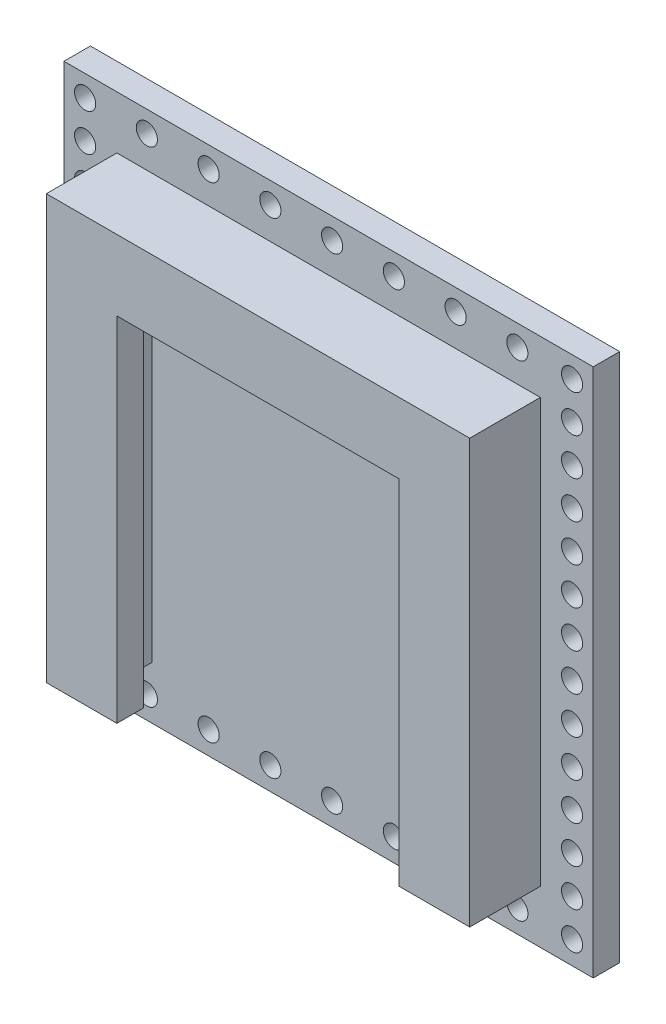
ISO-10303-21;
HEADER;
FILE_DESCRIPTION(('STEP AP214'),'2;1');
FILE_NAME('part.step','',(''),(''),'','','');
FILE_SCHEMA(('AUTOMOTIVE_DESIGN { 1 0 10303 214 1 1 1 1 }'));
ENDSEC;
DATA;
#1=APPLICATION_CONTEXT('core data for automotive mechanical design processes');
#2=APPLICATION_PROTOCOL_DEFINITION('international standard','automotive_design',2000,#1);
#3=PRODUCT_CONTEXT('',#1,'mechanical');
#4=PRODUCT('Part','Part','',(#3));
#5=PRODUCT_RELATED_PRODUCT_CATEGORY('part','',(#4));
#6=PRODUCT_DEFINITION_FORMATION('','',#4);
#7=PRODUCT_DEFINITION_CONTEXT('part definition',#1,'design');
#8=PRODUCT_DEFINITION('design','',#6,#7);
#9=PRODUCT_DEFINITION_SHAPE('','',#8);
#10=(LENGTH_UNIT() NAMED_UNIT(*) SI_UNIT(.MILLI.,.METRE.));
#11=(NAMED_UNIT(*) PLANE_ANGLE_UNIT() SI_UNIT($,.RADIAN.));
#12=(NAMED_UNIT(*) SI_UNIT($,.STERADIAN.) SOLID_ANGLE_UNIT());
#13=UNCERTAINTY_MEASURE_WITH_UNIT(LENGTH_MEASURE(1.E-05),#10,'distance_accuracy_value','');
#14=(GEOMETRIC_REPRESENTATION_CONTEXT(3) GLOBAL_UNCERTAINTY_ASSIGNED_CONTEXT((#13)) GLOBAL_UNIT_ASSIGNED_CONTEXT((#10,
#11,#12)) REPRESENTATION_CONTEXT('',''));
#15=CARTESIAN_POINT('',(0.,0.,0.));
#16=DIRECTION('',(0.,0.,1.));
#17=DIRECTION('',(1.,0.,0.));
#18=AXIS2_PLACEMENT_3D('',#15,#16,#17);
#19=CARTESIAN_POINT('',(0.,0.,1.));
#20=DIRECTION('',(0.,0.,-1.));
#21=DIRECTION('',(-1.,0.,0.));
#22=AXIS2_PLACEMENT_3D('',#19,#20,#21);
#23=PLANE('',#22);
#24=DIRECTION('',(0.,1.,0.));
#25=VECTOR('',#24,1.);
#26=CARTESIAN_POINT('',(15.,-15.,1.));
#27=LINE('',#26,#25);
#28=CARTESIAN_POINT('',(15.,-15.,1.));
#29=VERTEX_POINT('',#28);
#30=CARTESIAN_POINT('',(15.,15.,1.));
#31=VERTEX_POINT('',#30);
#32=EDGE_CURVE('E502',#29,#31,#27,.T.);
#33=ORIENTED_EDGE('',*,*,#32,.T.);
#34=DIRECTION('',(-1.,0.,0.));
#35=VECTOR('',#34,1.);
#36=CARTESIAN_POINT('',(-15.,15.,1.));
#37=LINE('',#36,#35);
#38=CARTESIAN_POINT('',(-15.,15.,1.));
#39=VERTEX_POINT('',#38);
#40=EDGE_CURVE('E505',#31,#39,#37,.T.);
#41=ORIENTED_EDGE('',*,*,#40,.T.);
#42=DIRECTION('',(0.,-1.,0.));
#43=VECTOR('',#42,1.);
#44=CARTESIAN_POINT('',(-15.,-15.,1.));
#45=LINE('',#44,#43);
#46=CARTESIAN_POINT('',(-15.,-15.,1.));
#47=VERTEX_POINT('',#46);
#48=EDGE_CURVE('E508',#39,#47,#45,.T.);
#49=ORIENTED_EDGE('',*,*,#48,.T.);
#50=DIRECTION('',(1.,0.,0.));
#51=VECTOR('',#50,1.);
#52=CARTESIAN_POINT('',(-15.,-15.,1.));
#53=LINE('',#52,#51);
#54=EDGE_CURVE('E511',#47,#29,#53,.T.);
#55=ORIENTED_EDGE('',*,*,#54,.T.);
#56=EDGE_LOOP('',(#33,#41,#49,#55));
#57=FACE_BOUND('',#56,.T.);
#58=CARTESIAN_POINT('',(-13.8,13.8,1.));
#59=DIRECTION('',(0.,0.,1.));
#60=DIRECTION('',(1.,0.,0.));
#61=AXIS2_PLACEMENT_3D('',#58,#59,#60);
#62=CIRCLE('',#61,0.6);
#63=CARTESIAN_POINT('',(-13.2,13.8,1.));
#64=VERTEX_POINT('',#63);
#65=EDGE_CURVE('E353',#64,#64,#62,.T.);
#66=ORIENTED_EDGE('',*,*,#65,.F.);
#67=EDGE_LOOP('',(#66));
#68=FACE_BOUND('',#67,.T.);
#69=CARTESIAN_POINT('',(7.2,-13.7,1.));
#70=DIRECTION('',(0.,0.,1.));
#71=DIRECTION('',(1.,0.,0.));
#72=AXIS2_PLACEMENT_3D('',#69,#70,#71);
#73=CIRCLE('',#72,0.6);
#74=CARTESIAN_POINT('',(7.8,-13.7,1.));
#75=VERTEX_POINT('',#74);
#76=EDGE_CURVE('E253',#75,#75,#73,.T.);
#77=ORIENTED_EDGE('',*,*,#76,.F.);
#78=EDGE_LOOP('',(#77));
#79=FACE_BOUND('',#78,.T.);
#80=CARTESIAN_POINT('',(3.7,-13.7,1.));
#81=DIRECTION('',(0.,0.,1.));
#82=DIRECTION('',(1.,0.,0.));
#83=AXIS2_PLACEMENT_3D('',#80,#81,#82);
#84=CIRCLE('',#83,0.6);
#85=CARTESIAN_POINT('',(4.3,-13.7,1.));
#86=VERTEX_POINT('',#85);
#87=EDGE_CURVE('E261',#86,#86,#84,.T.);
#88=ORIENTED_EDGE('',*,*,#87,.F.);
#89=EDGE_LOOP('',(#88));
#90=FACE_BOUND('',#89,.T.);
#91=CARTESIAN_POINT('',(0.199999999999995,-13.7,1.));
#92=DIRECTION('',(0.,0.,1.));
#93=DIRECTION('',(1.,0.,0.));
#94=AXIS2_PLACEMENT_3D('',#91,#92,#93);
#95=CIRCLE('',#94,0.6);
#96=CARTESIAN_POINT('',(0.799999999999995,-13.7,1.));
#97=VERTEX_POINT('',#96);
#98=EDGE_CURVE('E258',#97,#97,#95,.T.);
#99=ORIENTED_EDGE('',*,*,#98,.F.);
#100=EDGE_LOOP('',(#99));
#101=FACE_BOUND('',#100,.T.);
#102=CARTESIAN_POINT('',(-3.3,-13.7,1.));
#103=DIRECTION('',(0.,0.,1.));
#104=DIRECTION('',(1.,0.,0.));
#105=AXIS2_PLACEMENT_3D('',#102,#103,#104);
#106=CIRCLE('',#105,0.6);
#107=CARTESIAN_POINT('',(-2.7,-13.7,1.));
#108=VERTEX_POINT('',#107);
#109=EDGE_CURVE('E254',#108,#108,#106,.T.);
#110=ORIENTED_EDGE('',*,*,#109,.F.);
#111=EDGE_LOOP('',(#110));
#112=FACE_BOUND('',#111,.T.);
#113=CARTESIAN_POINT('',(-6.80000000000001,-13.7,1.));
#114=DIRECTION('',(0.,0.,1.));
#115=DIRECTION('',(1.,0.,0.));
#116=AXIS2_PLACEMENT_3D('',#113,#114,#115);
#117=CIRCLE('',#116,0.6);
#118=CARTESIAN_POINT('',(-6.2,-13.7,1.));
#119=VERTEX_POINT('',#118);
#120=EDGE_CURVE('E257',#119,#119,#117,.T.);
#121=ORIENTED_EDGE('',*,*,#120,.F.);
#122=EDGE_LOOP('',(#121));
#123=FACE_BOUND('',#122,.T.);
#124=CARTESIAN_POINT('',(-10.3,-13.7,1.));
#125=DIRECTION('',(0.,0.,1.));
#126=DIRECTION('',(1.,0.,0.));
#127=AXIS2_PLACEMENT_3D('',#124,#125,#126);
#128=CIRCLE('',#127,0.6);
#129=CARTESIAN_POINT('',(-9.7,-13.7,1.));
#130=VERTEX_POINT('',#129);
#131=EDGE_CURVE('E273',#130,#130,#128,.T.);
#132=ORIENTED_EDGE('',*,*,#131,.F.);
#133=EDGE_LOOP('',(#132));
#134=FACE_BOUND('',#133,.T.);
#135=CARTESIAN_POINT('',(10.7,13.8,1.));
#136=DIRECTION('',(0.,0.,1.));
#137=DIRECTION('',(1.,0.,0.));
#138=AXIS2_PLACEMENT_3D('',#135,#136,#137);
#139=CIRCLE('',#138,0.6);
#140=CARTESIAN_POINT('',(11.3,13.8,1.));
#141=VERTEX_POINT('',#140);
#142=EDGE_CURVE('E270',#141,#141,#139,.T.);
#143=ORIENTED_EDGE('',*,*,#142,.F.);
#144=EDGE_LOOP('',(#143));
#145=FACE_BOUND('',#144,.T.);
#146=CARTESIAN_POINT('',(7.2,13.8,1.));
#147=DIRECTION('',(0.,0.,1.));
#148=DIRECTION('',(1.,0.,0.));
#149=AXIS2_PLACEMENT_3D('',#146,#147,#148);
#150=CIRCLE('',#149,0.6);
#151=CARTESIAN_POINT('',(7.8,13.8,1.));
#152=VERTEX_POINT('',#151);
#153=EDGE_CURVE('E266',#152,#152,#150,.T.);
#154=ORIENTED_EDGE('',*,*,#153,.F.);
#155=EDGE_LOOP('',(#154));
#156=FACE_BOUND('',#155,.T.);
#157=CARTESIAN_POINT('',(10.7,-13.7,1.));
#158=DIRECTION('',(0.,0.,1.));
#159=DIRECTION('',(1.,0.,0.));
#160=AXIS2_PLACEMENT_3D('',#157,#158,#159);
#161=CIRCLE('',#160,0.6);
#162=CARTESIAN_POINT('',(11.3,-13.7,1.));
#163=VERTEX_POINT('',#162);
#164=EDGE_CURVE('E250',#163,#163,#161,.T.);
#165=ORIENTED_EDGE('',*,*,#164,.F.);
#166=EDGE_LOOP('',(#165));
#167=FACE_BOUND('',#166,.T.);
#168=CARTESIAN_POINT('',(-13.8,-5.23846153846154,1.));
#169=DIRECTION('',(0.,0.,1.));
#170=DIRECTION('',(1.,0.,0.));
#171=AXIS2_PLACEMENT_3D('',#168,#169,#170);
#172=CIRCLE('',#171,0.6);
#173=CARTESIAN_POINT('',(-13.2,-5.23846153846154,1.));
#174=VERTEX_POINT('',#173);
#175=EDGE_CURVE('E338',#174,#174,#172,.T.);
#176=ORIENTED_EDGE('',*,*,#175,.F.);
#177=EDGE_LOOP('',(#176));
#178=FACE_BOUND('',#177,.T.);
#179=CARTESIAN_POINT('',(-13.8,-7.35384615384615,1.));
#180=DIRECTION('',(0.,0.,1.));
#181=DIRECTION('',(1.,0.,0.));
#182=AXIS2_PLACEMENT_3D('',#179,#180,#181);
#183=CIRCLE('',#182,0.6);
#184=CARTESIAN_POINT('',(-13.2,-7.35384615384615,1.));
#185=VERTEX_POINT('',#184);
#186=EDGE_CURVE('E342',#185,#185,#183,.T.);
#187=ORIENTED_EDGE('',*,*,#186,.F.);
#188=EDGE_LOOP('',(#187));
#189=FACE_BOUND('',#188,.T.);
#190=CARTESIAN_POINT('',(-13.8,-9.46923076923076,1.));
#191=DIRECTION('',(0.,0.,1.));
#192=DIRECTION('',(1.,0.,0.));
#193=AXIS2_PLACEMENT_3D('',#190,#191,#192);
#194=CIRCLE('',#193,0.6);
#195=CARTESIAN_POINT('',(-13.2,-9.46923076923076,1.));
#196=VERTEX_POINT('',#195);
#197=EDGE_CURVE('E345',#196,#196,#194,.T.);
#198=ORIENTED_EDGE('',*,*,#197,.F.);
#199=EDGE_LOOP('',(#198));
#200=FACE_BOUND('',#199,.T.);
#201=CARTESIAN_POINT('',(-13.8,-11.5846153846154,1.));
#202=DIRECTION('',(0.,0.,1.));
#203=DIRECTION('',(1.,0.,0.));
#204=AXIS2_PLACEMENT_3D('',#201,#202,#203);
#205=CIRCLE('',#204,0.6);
#206=CARTESIAN_POINT('',(-13.2,-11.5846153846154,1.));
#207=VERTEX_POINT('',#206);
#208=EDGE_CURVE('E335',#207,#207,#205,.T.);
#209=ORIENTED_EDGE('',*,*,#208,.F.);
#210=EDGE_LOOP('',(#209));
#211=FACE_BOUND('',#210,.T.);
#212=CARTESIAN_POINT('',(13.8,9.56923076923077,1.));
#213=DIRECTION('',(0.,0.,1.));
#214=DIRECTION('',(1.,0.,0.));
#215=AXIS2_PLACEMENT_3D('',#212,#213,#214);
#216=CIRCLE('',#215,0.6);
#217=CARTESIAN_POINT('',(14.4,9.56923076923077,1.));
#218=VERTEX_POINT('',#217);
#219=EDGE_CURVE('E305',#218,#218,#216,.T.);
#220=ORIENTED_EDGE('',*,*,#219,.F.);
#221=EDGE_LOOP('',(#220));
#222=FACE_BOUND('',#221,.T.);
#223=CARTESIAN_POINT('',(13.8,11.6846153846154,1.));
#224=DIRECTION('',(0.,0.,1.));
#225=DIRECTION('',(1.,0.,0.));
#226=AXIS2_PLACEMENT_3D('',#223,#224,#225);
#227=CIRCLE('',#226,0.6);
#228=CARTESIAN_POINT('',(14.4,11.6846153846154,1.));
#229=VERTEX_POINT('',#228);
#230=EDGE_CURVE('E326',#229,#229,#227,.T.);
#231=ORIENTED_EDGE('',*,*,#230,.F.);
#232=EDGE_LOOP('',(#231));
#233=FACE_BOUND('',#232,.T.);
#234=CARTESIAN_POINT('',(13.8,13.8,1.));
#235=DIRECTION('',(0.,0.,1.));
#236=DIRECTION('',(1.,0.,0.));
#237=AXIS2_PLACEMENT_3D('',#234,#235,#236);
#238=CIRCLE('',#237,0.6);
#239=CARTESIAN_POINT('',(14.4,13.8,1.));
#240=VERTEX_POINT('',#239);
#241=EDGE_CURVE('E329',#240,#240,#238,.T.);
#242=ORIENTED_EDGE('',*,*,#241,.F.);
#243=EDGE_LOOP('',(#242));
#244=FACE_BOUND('',#243,.T.);
#245=CARTESIAN_POINT('',(-13.8,-13.7,1.));
#246=DIRECTION('',(0.,0.,1.));
#247=DIRECTION('',(1.,0.,0.));
#248=AXIS2_PLACEMENT_3D('',#245,#246,#247);
#249=CIRCLE('',#248,0.6);
#250=CARTESIAN_POINT('',(-13.2,-13.7,1.));
#251=VERTEX_POINT('',#250);
#252=EDGE_CURVE('E332',#251,#251,#249,.T.);
#253=ORIENTED_EDGE('',*,*,#252,.F.);
#254=EDGE_LOOP('',(#253));
#255=FACE_BOUND('',#254,.T.);
#256=CARTESIAN_POINT('',(-13.8,-3.12307692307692,1.));
#257=DIRECTION('',(0.,0.,1.));
#258=DIRECTION('',(1.,0.,0.));
#259=AXIS2_PLACEMENT_3D('',#256,#257,#258);
#260=CIRCLE('',#259,0.6);
#261=CARTESIAN_POINT('',(-13.2,-3.12307692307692,1.));
#262=VERTEX_POINT('',#261);
#263=EDGE_CURVE('E341',#262,#262,#260,.T.);
#264=ORIENTED_EDGE('',*,*,#263,.F.);
#265=EDGE_LOOP('',(#264));
#266=FACE_BOUND('',#265,.T.);
#267=CARTESIAN_POINT('',(-13.8,-1.00769230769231,1.));
#268=DIRECTION('',(0.,0.,1.));
#269=DIRECTION('',(1.,0.,0.));
#270=AXIS2_PLACEMENT_3D('',#267,#268,#269);
#271=CIRCLE('',#270,0.6);
#272=CARTESIAN_POINT('',(-13.2,-1.00769230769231,1.));
#273=VERTEX_POINT('',#272);
#274=EDGE_CURVE('E369',#273,#273,#271,.T.);
#275=ORIENTED_EDGE('',*,*,#274,.F.);
#276=EDGE_LOOP('',(#275));
#277=FACE_BOUND('',#276,.T.);
#278=CARTESIAN_POINT('',(-13.8,1.10769230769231,1.));
#279=DIRECTION('',(0.,0.,1.));
#280=DIRECTION('',(1.,0.,0.));
#281=AXIS2_PLACEMENT_3D('',#278,#279,#280);
#282=CIRCLE('',#281,0.6);
#283=CARTESIAN_POINT('',(-13.2,1.10769230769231,1.));
#284=VERTEX_POINT('',#283);
#285=EDGE_CURVE('E366',#284,#284,#282,.T.);
#286=ORIENTED_EDGE('',*,*,#285,.F.);
#287=EDGE_LOOP('',(#286));
#288=FACE_BOUND('',#287,.T.);
#289=CARTESIAN_POINT('',(-13.8,3.22307692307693,1.));
#290=DIRECTION('',(0.,0.,1.));
#291=DIRECTION('',(1.,0.,0.));
#292=AXIS2_PLACEMENT_3D('',#289,#290,#291);
#293=CIRCLE('',#292,0.6);
#294=CARTESIAN_POINT('',(-13.2,3.22307692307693,1.));
#295=VERTEX_POINT('',#294);
#296=EDGE_CURVE('E363',#295,#295,#293,.T.);
#297=ORIENTED_EDGE('',*,*,#296,.F.);
#298=EDGE_LOOP('',(#297));
#299=FACE_BOUND('',#298,.T.);
#300=CARTESIAN_POINT('',(-13.8,5.33846153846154,1.));
#301=DIRECTION('',(0.,0.,1.));
#302=DIRECTION('',(1.,0.,0.));
#303=AXIS2_PLACEMENT_3D('',#300,#301,#302);
#304=CIRCLE('',#303,0.6);
#305=CARTESIAN_POINT('',(-13.2,5.33846153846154,1.));
#306=VERTEX_POINT('',#305);
#307=EDGE_CURVE('E360',#306,#306,#304,.T.);
#308=ORIENTED_EDGE('',*,*,#307,.F.);
#309=EDGE_LOOP('',(#308));
#310=FACE_BOUND('',#309,.T.);
#311=CARTESIAN_POINT('',(-13.8,7.45384615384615,1.));
#312=DIRECTION('',(0.,0.,1.));
#313=DIRECTION('',(1.,0.,0.));
#314=AXIS2_PLACEMENT_3D('',#311,#312,#313);
#315=CIRCLE('',#314,0.6);
#316=CARTESIAN_POINT('',(-13.2,7.45384615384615,1.));
#317=VERTEX_POINT('',#316);
#318=EDGE_CURVE('E357',#317,#317,#315,.T.);
#319=ORIENTED_EDGE('',*,*,#318,.F.);
#320=EDGE_LOOP('',(#319));
#321=FACE_BOUND('',#320,.T.);
#322=CARTESIAN_POINT('',(-13.8,9.56923076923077,1.));
#323=DIRECTION('',(0.,0.,1.));
#324=DIRECTION('',(1.,0.,0.));
#325=AXIS2_PLACEMENT_3D('',#322,#323,#324);
#326=CIRCLE('',#325,0.6);
#327=CARTESIAN_POINT('',(-13.2,9.56923076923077,1.));
#328=VERTEX_POINT('',#327);
#329=EDGE_CURVE('E354',#328,#328,#326,.T.);
#330=ORIENTED_EDGE('',*,*,#329,.F.);
#331=EDGE_LOOP('',(#330));
#332=FACE_BOUND('',#331,.T.);
#333=CARTESIAN_POINT('',(-13.8,11.6846153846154,1.));
#334=DIRECTION('',(0.,0.,1.));
#335=DIRECTION('',(1.,0.,0.));
#336=AXIS2_PLACEMENT_3D('',#333,#334,#335);
#337=CIRCLE('',#336,0.6);
#338=CARTESIAN_POINT('',(-13.2,11.6846153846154,1.));
#339=VERTEX_POINT('',#338);
#340=EDGE_CURVE('E350',#339,#339,#337,.T.);
#341=ORIENTED_EDGE('',*,*,#340,.F.);
#342=EDGE_LOOP('',(#341));
#343=FACE_BOUND('',#342,.T.);
#344=CARTESIAN_POINT('',(-10.3,13.8,1.));
#345=DIRECTION('',(0.,0.,1.));
#346=DIRECTION('',(1.,0.,0.));
#347=AXIS2_PLACEMENT_3D('',#344,#345,#346);
#348=CIRCLE('',#347,0.6);
#349=CARTESIAN_POINT('',(-9.7,13.8,1.));
#350=VERTEX_POINT('',#349);
#351=EDGE_CURVE('E281',#350,#350,#348,.T.);
#352=ORIENTED_EDGE('',*,*,#351,.F.);
#353=EDGE_LOOP('',(#352));
#354=FACE_BOUND('',#353,.T.);
#355=CARTESIAN_POINT('',(13.8,-13.7,1.));
#356=DIRECTION('',(0.,0.,1.));
#357=DIRECTION('',(1.,0.,0.));
#358=AXIS2_PLACEMENT_3D('',#355,#356,#357);
#359=CIRCLE('',#358,0.6);
#360=CARTESIAN_POINT('',(14.4,-13.7,1.));
#361=VERTEX_POINT('',#360);
#362=EDGE_CURVE('E290',#361,#361,#359,.T.);
#363=ORIENTED_EDGE('',*,*,#362,.F.);
#364=EDGE_LOOP('',(#363));
#365=FACE_BOUND('',#364,.T.);
#366=CARTESIAN_POINT('',(13.8,-11.5846153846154,1.));
#367=DIRECTION('',(0.,0.,1.));
#368=DIRECTION('',(1.,0.,0.));
#369=AXIS2_PLACEMENT_3D('',#366,#367,#368);
#370=CIRCLE('',#369,0.6);
#371=CARTESIAN_POINT('',(14.4,-11.5846153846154,1.));
#372=VERTEX_POINT('',#371);
#373=EDGE_CURVE('E293',#372,#372,#370,.T.);
#374=ORIENTED_EDGE('',*,*,#373,.F.);
#375=EDGE_LOOP('',(#374));
#376=FACE_BOUND('',#375,.T.);
#377=CARTESIAN_POINT('',(13.8,-9.46923076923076,1.));
#378=DIRECTION('',(0.,0.,1.));
#379=DIRECTION('',(1.,0.,0.));
#380=AXIS2_PLACEMENT_3D('',#377,#378,#379);
#381=CIRCLE('',#380,0.6);
#382=CARTESIAN_POINT('',(14.4,-9.46923076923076,1.));
#383=VERTEX_POINT('',#382);
#384=EDGE_CURVE('E296',#383,#383,#381,.T.);
#385=ORIENTED_EDGE('',*,*,#384,.F.);
#386=EDGE_LOOP('',(#385));
#387=FACE_BOUND('',#386,.T.);
#388=CARTESIAN_POINT('',(-6.80000000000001,13.8,1.));
#389=DIRECTION('',(0.,0.,1.));
#390=DIRECTION('',(1.,0.,0.));
#391=AXIS2_PLACEMENT_3D('',#388,#389,#390);
#392=CIRCLE('',#391,0.6);
#393=CARTESIAN_POINT('',(-6.2,13.8,1.));
#394=VERTEX_POINT('',#393);
#395=EDGE_CURVE('E278',#394,#394,#392,.T.);
#396=ORIENTED_EDGE('',*,*,#395,.F.);
#397=EDGE_LOOP('',(#396));
#398=FACE_BOUND('',#397,.T.);
#399=CARTESIAN_POINT('',(-3.3,13.8,1.));
#400=DIRECTION('',(0.,0.,1.));
#401=DIRECTION('',(1.,0.,0.));
#402=AXIS2_PLACEMENT_3D('',#399,#400,#401);
#403=CIRCLE('',#402,0.6);
#404=CARTESIAN_POINT('',(-2.7,13.8,1.));
#405=VERTEX_POINT('',#404);
#406=EDGE_CURVE('E282',#405,#405,#403,.T.);
#407=ORIENTED_EDGE('',*,*,#406,.F.);
#408=EDGE_LOOP('',(#407));
#409=FACE_BOUND('',#408,.T.);
#410=CARTESIAN_POINT('',(0.199999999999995,13.8,1.));
#411=DIRECTION('',(0.,0.,1.));
#412=DIRECTION('',(1.,0.,0.));
#413=AXIS2_PLACEMENT_3D('',#410,#411,#412);
#414=CIRCLE('',#413,0.6);
#415=CARTESIAN_POINT('',(0.799999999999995,13.8,1.));
#416=VERTEX_POINT('',#415);
#417=EDGE_CURVE('E285',#416,#416,#414,.T.);
#418=ORIENTED_EDGE('',*,*,#417,.F.);
#419=EDGE_LOOP('',(#418));
#420=FACE_BOUND('',#419,.T.);
#421=CARTESIAN_POINT('',(3.7,13.8,1.));
#422=DIRECTION('',(0.,0.,1.));
#423=DIRECTION('',(1.,0.,0.));
#424=AXIS2_PLACEMENT_3D('',#421,#422,#423);
#425=CIRCLE('',#424,0.6);
#426=CARTESIAN_POINT('',(4.3,13.8,1.));
#427=VERTEX_POINT('',#426);
#428=EDGE_CURVE('E269',#427,#427,#425,.T.);
#429=ORIENTED_EDGE('',*,*,#428,.F.);
#430=EDGE_LOOP('',(#429));
#431=FACE_BOUND('',#430,.T.);
#432=CARTESIAN_POINT('',(13.8,-7.35384615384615,1.));
#433=DIRECTION('',(0.,0.,1.));
#434=DIRECTION('',(1.,0.,0.));
#435=AXIS2_PLACEMENT_3D('',#432,#433,#434);
#436=CIRCLE('',#435,0.6);
#437=CARTESIAN_POINT('',(14.4,-7.35384615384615,1.));
#438=VERTEX_POINT('',#437);
#439=EDGE_CURVE('E299',#438,#438,#436,.T.);
#440=ORIENTED_EDGE('',*,*,#439,.F.);
#441=EDGE_LOOP('',(#440));
#442=FACE_BOUND('',#441,.T.);
#443=CARTESIAN_POINT('',(13.8,-5.23846153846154,1.));
#444=DIRECTION('',(0.,0.,1.));
#445=DIRECTION('',(1.,0.,0.));
#446=AXIS2_PLACEMENT_3D('',#443,#444,#445);
#447=CIRCLE('',#446,0.6);
#448=CARTESIAN_POINT('',(14.4,-5.23846153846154,1.));
#449=VERTEX_POINT('',#448);
#450=EDGE_CURVE('E321',#449,#449,#447,.T.);
#451=ORIENTED_EDGE('',*,*,#450,.F.);
#452=EDGE_LOOP('',(#451));
#453=FACE_BOUND('',#452,.T.);
#454=CARTESIAN_POINT('',(13.8,-3.12307692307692,1.));
#455=DIRECTION('',(0.,0.,1.));
#456=DIRECTION('',(1.,0.,0.));
#457=AXIS2_PLACEMENT_3D('',#454,#455,#456);
#458=CIRCLE('',#457,0.6);
#459=CARTESIAN_POINT('',(14.4,-3.12307692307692,1.));
#460=VERTEX_POINT('',#459);
#461=EDGE_CURVE('E318',#460,#460,#458,.T.);
#462=ORIENTED_EDGE('',*,*,#461,.F.);
#463=EDGE_LOOP('',(#462));
#464=FACE_BOUND('',#463,.T.);
#465=CARTESIAN_POINT('',(13.8,-1.00769230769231,1.));
#466=DIRECTION('',(0.,0.,1.));
#467=DIRECTION('',(1.,0.,0.));
#468=AXIS2_PLACEMENT_3D('',#465,#466,#467);
#469=CIRCLE('',#468,0.6);
#470=CARTESIAN_POINT('',(14.4,-1.00769230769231,1.));
#471=VERTEX_POINT('',#470);
#472=EDGE_CURVE('E315',#471,#471,#469,.T.);
#473=ORIENTED_EDGE('',*,*,#472,.F.);
#474=EDGE_LOOP('',(#473));
#475=FACE_BOUND('',#474,.T.);
#476=CARTESIAN_POINT('',(13.8,1.10769230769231,1.));
#477=DIRECTION('',(0.,0.,1.));
#478=DIRECTION('',(1.,0.,0.));
#479=AXIS2_PLACEMENT_3D('',#476,#477,#478);
#480=CIRCLE('',#479,0.6);
#481=CARTESIAN_POINT('',(14.4,1.10769230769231,1.));
#482=VERTEX_POINT('',#481);
#483=EDGE_CURVE('E312',#482,#482,#480,.T.);
#484=ORIENTED_EDGE('',*,*,#483,.F.);
#485=EDGE_LOOP('',(#484));
#486=FACE_BOUND('',#485,.T.);
#487=CARTESIAN_POINT('',(13.8,3.22307692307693,1.));
#488=DIRECTION('',(0.,0.,1.));
#489=DIRECTION('',(1.,0.,0.));
#490=AXIS2_PLACEMENT_3D('',#487,#488,#489);
#491=CIRCLE('',#490,0.6);
#492=CARTESIAN_POINT('',(14.4,3.22307692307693,1.));
#493=VERTEX_POINT('',#492);
#494=EDGE_CURVE('E309',#493,#493,#491,.T.);
#495=ORIENTED_EDGE('',*,*,#494,.F.);
#496=EDGE_LOOP('',(#495));
#497=FACE_BOUND('',#496,.T.);
#498=CARTESIAN_POINT('',(13.8,5.33846153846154,1.));
#499=DIRECTION('',(0.,0.,1.));
#500=DIRECTION('',(1.,0.,0.));
#501=AXIS2_PLACEMENT_3D('',#498,#499,#500);
#502=CIRCLE('',#501,0.6);
#503=CARTESIAN_POINT('',(14.4,5.33846153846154,1.));
#504=VERTEX_POINT('',#503);
#505=EDGE_CURVE('E306',#504,#504,#502,.T.);
#506=ORIENTED_EDGE('',*,*,#505,.F.);
#507=EDGE_LOOP('',(#506));
#508=FACE_BOUND('',#507,.T.);
#509=CARTESIAN_POINT('',(13.8,7.45384615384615,1.));
#510=DIRECTION('',(0.,0.,1.));
#511=DIRECTION('',(1.,0.,0.));
#512=AXIS2_PLACEMENT_3D('',#509,#510,#511);
#513=CIRCLE('',#512,0.6);
#514=CARTESIAN_POINT('',(14.4,7.45384615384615,1.));
#515=VERTEX_POINT('',#514);
#516=EDGE_CURVE('E302',#515,#515,#513,.T.);
#517=ORIENTED_EDGE('',*,*,#516,.F.);
#518=EDGE_LOOP('',(#517));
#519=FACE_BOUND('',#518,.T.);
#520=DIRECTION('',(1.,0.,0.));
#521=VECTOR('',#520,1.);
#522=CARTESIAN_POINT('',(8.00000000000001,-12.,1.));
#523=LINE('',#522,#521);
#524=CARTESIAN_POINT('',(10.,-12.,1.));
#525=VERTEX_POINT('',#524);
#526=CARTESIAN_POINT('',(12.,-12.,1.));
#527=VERTEX_POINT('',#526);
#528=EDGE_CURVE('E203',#525,#527,#523,.T.);
#529=ORIENTED_EDGE('',*,*,#528,.F.);
#530=DIRECTION('',(0.,-1.,0.));
#531=VECTOR('',#530,1.);
#532=CARTESIAN_POINT('',(9.99999999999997,28.1556443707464,1.));
#533=LINE('',#532,#531);
#534=CARTESIAN_POINT('',(10.,8.,1.));
#535=VERTEX_POINT('',#534);
#536=EDGE_CURVE('E60',#535,#525,#533,.T.);
#537=ORIENTED_EDGE('',*,*,#536,.F.);
#538=DIRECTION('',(1.,0.,0.));
#539=VECTOR('',#538,1.);
#540=CARTESIAN_POINT('',(-8.,8.,1.));
#541=LINE('',#540,#539);
#542=CARTESIAN_POINT('',(-10.,8.,1.));
#543=VERTEX_POINT('',#542);
#544=EDGE_CURVE('E227',#543,#535,#541,.T.);
#545=ORIENTED_EDGE('',*,*,#544,.F.);
#546=DIRECTION('',(0.,-1.,0.));
#547=VECTOR('',#546,1.);
#548=CARTESIAN_POINT('',(-10.,28.1556443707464,1.));
#549=LINE('',#548,#547);
#550=CARTESIAN_POINT('',(-10.,-12.,1.));
#551=VERTEX_POINT('',#550);
#552=EDGE_CURVE('E180',#543,#551,#549,.T.);
#553=ORIENTED_EDGE('',*,*,#552,.T.);
#554=DIRECTION('',(1.,0.,0.));
#555=VECTOR('',#554,1.);
#556=CARTESIAN_POINT('',(-12.,-12.,1.));
#557=LINE('',#556,#555);
#558=CARTESIAN_POINT('',(-12.,-12.,1.));
#559=VERTEX_POINT('',#558);
#560=EDGE_CURVE('E224',#559,#551,#557,.T.);
#561=ORIENTED_EDGE('',*,*,#560,.F.);
#562=DIRECTION('',(0.,-1.,0.));
#563=VECTOR('',#562,1.);
#564=CARTESIAN_POINT('',(-12.,-12.,1.));
#565=LINE('',#564,#563);
#566=CARTESIAN_POINT('',(-12.,12.,1.));
#567=VERTEX_POINT('',#566);
#568=EDGE_CURVE('E221',#567,#559,#565,.T.);
#569=ORIENTED_EDGE('',*,*,#568,.F.);
#570=DIRECTION('',(-1.,0.,0.));
#571=VECTOR('',#570,1.);
#572=CARTESIAN_POINT('',(-12.,12.,1.));
#573=LINE('',#572,#571);
#574=CARTESIAN_POINT('',(12.,12.,1.));
#575=VERTEX_POINT('',#574);
#576=EDGE_CURVE('E68',#575,#567,#573,.T.);
#577=ORIENTED_EDGE('',*,*,#576,.F.);
#578=DIRECTION('',(0.,1.,0.));
#579=VECTOR('',#578,1.);
#580=CARTESIAN_POINT('',(12.,-12.,1.));
#581=LINE('',#580,#579);
#582=EDGE_CURVE('E198',#527,#575,#581,.T.);
#583=ORIENTED_EDGE('',*,*,#582,.F.);
#584=EDGE_LOOP('',(#529,#537,#545,#553,#561,#569,#577,#583));
#585=FACE_BOUND('',#584,.T.);
#586=ADVANCED_FACE('F43',(#57,#68,#79,#90,#101,#112,#123,#134,#145,#156,#167,#178,#189,#200,
#211,#222,#233,#244,#255,#266,#277,#288,#299,#310,#321,#332,#343,#354,#365,#376,#387,#398,#409,
#420,#431,#442,#453,#464,#475,#486,#497,#508,#519,#585),#23,.F.);
#587=CARTESIAN_POINT('',(15.,-15.,-0.5));
#588=DIRECTION('',(1.,0.,0.));
#589=DIRECTION('',(0.,0.,-1.));
#590=AXIS2_PLACEMENT_3D('',#587,#588,#589);
#591=PLANE('',#590);
#592=DIRECTION('',(0.,0.,1.));
#593=VECTOR('',#592,1.);
#594=CARTESIAN_POINT('',(15.,15.,-0.5));
#595=LINE('',#594,#593);
#596=CARTESIAN_POINT('',(15.,15.,-0.5));
#597=VERTEX_POINT('',#596);
#598=EDGE_CURVE('E47',#597,#31,#595,.T.);
#599=ORIENTED_EDGE('',*,*,#598,.T.);
#600=ORIENTED_EDGE('',*,*,#32,.F.);
#601=DIRECTION('',(0.,0.,1.));
#602=VECTOR('',#601,1.);
#603=CARTESIAN_POINT('',(15.,-15.,-0.5));
#604=LINE('',#603,#602);
#605=CARTESIAN_POINT('',(15.,-15.,-0.5));
#606=VERTEX_POINT('',#605);
#607=EDGE_CURVE('E11',#606,#29,#604,.T.);
#608=ORIENTED_EDGE('',*,*,#607,.F.);
#609=DIRECTION('',(0.,1.,0.));
#610=VECTOR('',#609,1.);
#611=CARTESIAN_POINT('',(15.,-15.,-0.5));
#612=LINE('',#611,#610);
#613=EDGE_CURVE('E514',#606,#597,#612,.T.);
#614=ORIENTED_EDGE('',*,*,#613,.T.);
#615=EDGE_LOOP('',(#599,#600,#608,#614));
#616=FACE_BOUND('',#615,.T.);
#617=ADVANCED_FACE('F45',(#616),#591,.T.);
#618=CARTESIAN_POINT('',(-15.,-15.,-0.5));
#619=DIRECTION('',(0.,-1.,0.));
#620=DIRECTION('',(0.,0.,-1.));
#621=AXIS2_PLACEMENT_3D('',#618,#619,#620);
#622=PLANE('',#621);
#623=ORIENTED_EDGE('',*,*,#607,.T.);
#624=ORIENTED_EDGE('',*,*,#54,.F.);
#625=DIRECTION('',(0.,0.,1.));
#626=VECTOR('',#625,1.);
#627=CARTESIAN_POINT('',(-15.,-15.,-0.5));
#628=LINE('',#627,#626);
#629=CARTESIAN_POINT('',(-15.,-15.,-0.5));
#630=VERTEX_POINT('',#629);
#631=EDGE_CURVE('E52',#630,#47,#628,.T.);
#632=ORIENTED_EDGE('',*,*,#631,.F.);
#633=DIRECTION('',(1.,0.,0.));
#634=VECTOR('',#633,1.);
#635=CARTESIAN_POINT('',(-15.,-15.,-0.5));
#636=LINE('',#635,#634);
#637=EDGE_CURVE('E523',#630,#606,#636,.T.);
#638=ORIENTED_EDGE('',*,*,#637,.T.);
#639=EDGE_LOOP('',(#623,#624,#632,#638));
#640=FACE_BOUND('',#639,.T.);
#641=ADVANCED_FACE('F539',(#640),#622,.T.);
#642=CARTESIAN_POINT('',(-15.,-15.,-0.5));
#643=DIRECTION('',(-1.,0.,0.));
#644=DIRECTION('',(0.,0.,1.));
#645=AXIS2_PLACEMENT_3D('',#642,#643,#644);
#646=PLANE('',#645);
#647=ORIENTED_EDGE('',*,*,#631,.T.);
#648=ORIENTED_EDGE('',*,*,#48,.F.);
#649=DIRECTION('',(0.,0.,1.));
#650=VECTOR('',#649,1.);
#651=CARTESIAN_POINT('',(-15.,15.,-0.5));
#652=LINE('',#651,#650);
#653=CARTESIAN_POINT('',(-15.,15.,-0.5));
#654=VERTEX_POINT('',#653);
#655=EDGE_CURVE('E526',#654,#39,#652,.T.);
#656=ORIENTED_EDGE('',*,*,#655,.F.);
#657=DIRECTION('',(0.,-1.,0.));
#658=VECTOR('',#657,1.);
#659=CARTESIAN_POINT('',(-15.,-15.,-0.5));
#660=LINE('',#659,#658);
#661=EDGE_CURVE('E520',#654,#630,#660,.T.);
#662=ORIENTED_EDGE('',*,*,#661,.T.);
#663=EDGE_LOOP('',(#647,#648,#656,#662));
#664=FACE_BOUND('',#663,.T.);
#665=ADVANCED_FACE('F545',(#664),#646,.T.);
#666=CARTESIAN_POINT('',(-15.,15.,-0.5));
#667=DIRECTION('',(0.,1.,0.));
#668=DIRECTION('',(0.,0.,1.));
#669=AXIS2_PLACEMENT_3D('',#666,#667,#668);
#670=PLANE('',#669);
#671=ORIENTED_EDGE('',*,*,#655,.T.);
#672=ORIENTED_EDGE('',*,*,#40,.F.);
#673=ORIENTED_EDGE('',*,*,#598,.F.);
#674=DIRECTION('',(-1.,0.,0.));
#675=VECTOR('',#674,1.);
#676=CARTESIAN_POINT('',(-15.,15.,-0.5));
#677=LINE('',#676,#675);
#678=EDGE_CURVE('E517',#597,#654,#677,.T.);
#679=ORIENTED_EDGE('',*,*,#678,.T.);
#680=EDGE_LOOP('',(#671,#672,#673,#679));
#681=FACE_BOUND('',#680,.T.);
#682=ADVANCED_FACE('F533',(#681),#670,.T.);
#683=CARTESIAN_POINT('',(0.,0.,-0.5));
#684=DIRECTION('',(0.,0.,-1.));
#685=DIRECTION('',(-1.,0.,0.));
#686=AXIS2_PLACEMENT_3D('',#683,#684,#685);
#687=PLANE('',#686);
#688=CARTESIAN_POINT('',(13.8,7.45384615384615,-0.5));
#689=DIRECTION('',(0.,0.,-1.));
#690=DIRECTION('',(-1.,0.,0.));
#691=AXIS2_PLACEMENT_3D('',#688,#689,#690);
#692=CIRCLE('',#691,0.6);
#693=CARTESIAN_POINT('',(13.2,7.45384615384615,-0.5));
#694=VERTEX_POINT('',#693);
#695=EDGE_CURVE('E499',#694,#694,#692,.T.);
#696=ORIENTED_EDGE('',*,*,#695,.F.);
#697=EDGE_LOOP('',(#696));
#698=FACE_BOUND('',#697,.T.);
#699=CARTESIAN_POINT('',(13.8,5.33846153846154,-0.5));
#700=DIRECTION('',(0.,0.,-1.));
#701=DIRECTION('',(-1.,0.,0.));
#702=AXIS2_PLACEMENT_3D('',#699,#700,#701);
#703=CIRCLE('',#702,0.6);
#704=CARTESIAN_POINT('',(13.2,5.33846153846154,-0.5));
#705=VERTEX_POINT('',#704);
#706=EDGE_CURVE('E496',#705,#705,#703,.T.);
#707=ORIENTED_EDGE('',*,*,#706,.F.);
#708=EDGE_LOOP('',(#707));
#709=FACE_BOUND('',#708,.T.);
#710=CARTESIAN_POINT('',(13.8,3.22307692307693,-0.5));
#711=DIRECTION('',(0.,0.,-1.));
#712=DIRECTION('',(-1.,0.,0.));
#713=AXIS2_PLACEMENT_3D('',#710,#711,#712);
#714=CIRCLE('',#713,0.6);
#715=CARTESIAN_POINT('',(13.2,3.22307692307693,-0.5));
#716=VERTEX_POINT('',#715);
#717=EDGE_CURVE('E493',#716,#716,#714,.T.);
#718=ORIENTED_EDGE('',*,*,#717,.F.);
#719=EDGE_LOOP('',(#718));
#720=FACE_BOUND('',#719,.T.);
#721=CARTESIAN_POINT('',(13.8,1.10769230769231,-0.5));
#722=DIRECTION('',(0.,0.,-1.));
#723=DIRECTION('',(-1.,0.,0.));
#724=AXIS2_PLACEMENT_3D('',#721,#722,#723);
#725=CIRCLE('',#724,0.6);
#726=CARTESIAN_POINT('',(13.2,1.10769230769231,-0.5));
#727=VERTEX_POINT('',#726);
#728=EDGE_CURVE('E490',#727,#727,#725,.T.);
#729=ORIENTED_EDGE('',*,*,#728,.F.);
#730=EDGE_LOOP('',(#729));
#731=FACE_BOUND('',#730,.T.);
#732=CARTESIAN_POINT('',(13.8,-1.00769230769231,-0.5));
#733=DIRECTION('',(0.,0.,-1.));
#734=DIRECTION('',(-1.,0.,0.));
#735=AXIS2_PLACEMENT_3D('',#732,#733,#734);
#736=CIRCLE('',#735,0.6);
#737=CARTESIAN_POINT('',(13.2,-1.00769230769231,-0.5));
#738=VERTEX_POINT('',#737);
#739=EDGE_CURVE('E487',#738,#738,#736,.T.);
#740=ORIENTED_EDGE('',*,*,#739,.F.);
#741=EDGE_LOOP('',(#740));
#742=FACE_BOUND('',#741,.T.);
#743=CARTESIAN_POINT('',(13.8,-3.12307692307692,-0.5));
#744=DIRECTION('',(0.,0.,-1.));
#745=DIRECTION('',(-1.,0.,0.));
#746=AXIS2_PLACEMENT_3D('',#743,#744,#745);
#747=CIRCLE('',#746,0.6);
#748=CARTESIAN_POINT('',(13.2,-3.12307692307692,-0.5));
#749=VERTEX_POINT('',#748);
#750=EDGE_CURVE('E484',#749,#749,#747,.T.);
#751=ORIENTED_EDGE('',*,*,#750,.F.);
#752=EDGE_LOOP('',(#751));
#753=FACE_BOUND('',#752,.T.);
#754=CARTESIAN_POINT('',(13.8,-5.23846153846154,-0.5));
#755=DIRECTION('',(0.,0.,-1.));
#756=DIRECTION('',(-1.,0.,0.));
#757=AXIS2_PLACEMENT_3D('',#754,#755,#756);
#758=CIRCLE('',#757,0.6);
#759=CARTESIAN_POINT('',(13.2,-5.23846153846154,-0.5));
#760=VERTEX_POINT('',#759);
#761=EDGE_CURVE('E481',#760,#760,#758,.T.);
#762=ORIENTED_EDGE('',*,*,#761,.F.);
#763=EDGE_LOOP('',(#762));
#764=FACE_BOUND('',#763,.T.);
#765=CARTESIAN_POINT('',(13.8,-7.35384615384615,-0.5));
#766=DIRECTION('',(0.,0.,-1.));
#767=DIRECTION('',(-1.,0.,0.));
#768=AXIS2_PLACEMENT_3D('',#765,#766,#767);
#769=CIRCLE('',#768,0.6);
#770=CARTESIAN_POINT('',(13.2,-7.35384615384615,-0.5));
#771=VERTEX_POINT('',#770);
#772=EDGE_CURVE('E478',#771,#771,#769,.T.);
#773=ORIENTED_EDGE('',*,*,#772,.F.);
#774=EDGE_LOOP('',(#773));
#775=FACE_BOUND('',#774,.T.);
#776=CARTESIAN_POINT('',(3.7,13.8,-0.5));
#777=DIRECTION('',(0.,0.,-1.));
#778=DIRECTION('',(-1.,0.,0.));
#779=AXIS2_PLACEMENT_3D('',#776,#777,#778);
#780=CIRCLE('',#779,0.6);
#781=CARTESIAN_POINT('',(3.1,13.8,-0.5));
#782=VERTEX_POINT('',#781);
#783=EDGE_CURVE('E475',#782,#782,#780,.T.);
#784=ORIENTED_EDGE('',*,*,#783,.F.);
#785=EDGE_LOOP('',(#784));
#786=FACE_BOUND('',#785,.T.);
#787=CARTESIAN_POINT('',(0.199999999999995,13.8,-0.5));
#788=DIRECTION('',(0.,0.,-1.));
#789=DIRECTION('',(-1.,0.,0.));
#790=AXIS2_PLACEMENT_3D('',#787,#788,#789);
#791=CIRCLE('',#790,0.6);
#792=CARTESIAN_POINT('',(-0.400000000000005,13.8,-0.5));
#793=VERTEX_POINT('',#792);
#794=EDGE_CURVE('E472',#793,#793,#791,.T.);
#795=ORIENTED_EDGE('',*,*,#794,.F.);
#796=EDGE_LOOP('',(#795));
#797=FACE_BOUND('',#796,.T.);
#798=CARTESIAN_POINT('',(-3.3,13.8,-0.5));
#799=DIRECTION('',(0.,0.,-1.));
#800=DIRECTION('',(-1.,0.,0.));
#801=AXIS2_PLACEMENT_3D('',#798,#799,#800);
#802=CIRCLE('',#801,0.6);
#803=CARTESIAN_POINT('',(-3.9,13.8,-0.5));
#804=VERTEX_POINT('',#803);
#805=EDGE_CURVE('E469',#804,#804,#802,.T.);
#806=ORIENTED_EDGE('',*,*,#805,.F.);
#807=EDGE_LOOP('',(#806));
#808=FACE_BOUND('',#807,.T.);
#809=CARTESIAN_POINT('',(-6.80000000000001,13.8,-0.5));
#810=DIRECTION('',(0.,0.,-1.));
#811=DIRECTION('',(-1.,0.,0.));
#812=AXIS2_PLACEMENT_3D('',#809,#810,#811);
#813=CIRCLE('',#812,0.6);
#814=CARTESIAN_POINT('',(-7.4,13.8,-0.5));
#815=VERTEX_POINT('',#814);
#816=EDGE_CURVE('E466',#815,#815,#813,.T.);
#817=ORIENTED_EDGE('',*,*,#816,.F.);
#818=EDGE_LOOP('',(#817));
#819=FACE_BOUND('',#818,.T.);
#820=CARTESIAN_POINT('',(13.8,-9.46923076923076,-0.5));
#821=DIRECTION('',(0.,0.,-1.));
#822=DIRECTION('',(-1.,0.,0.));
#823=AXIS2_PLACEMENT_3D('',#820,#821,#822);
#824=CIRCLE('',#823,0.6);
#825=CARTESIAN_POINT('',(13.2,-9.46923076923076,-0.5));
#826=VERTEX_POINT('',#825);
#827=EDGE_CURVE('E463',#826,#826,#824,.T.);
#828=ORIENTED_EDGE('',*,*,#827,.F.);
#829=EDGE_LOOP('',(#828));
#830=FACE_BOUND('',#829,.T.);
#831=CARTESIAN_POINT('',(13.8,-11.5846153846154,-0.5));
#832=DIRECTION('',(0.,0.,-1.));
#833=DIRECTION('',(-1.,0.,0.));
#834=AXIS2_PLACEMENT_3D('',#831,#832,#833);
#835=CIRCLE('',#834,0.6);
#836=CARTESIAN_POINT('',(13.2,-11.5846153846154,-0.5));
#837=VERTEX_POINT('',#836);
#838=EDGE_CURVE('E460',#837,#837,#835,.T.);
#839=ORIENTED_EDGE('',*,*,#838,.F.);
#840=EDGE_LOOP('',(#839));
#841=FACE_BOUND('',#840,.T.);
#842=CARTESIAN_POINT('',(13.8,-13.7,-0.5));
#843=DIRECTION('',(0.,0.,-1.));
#844=DIRECTION('',(-1.,0.,0.));
#845=AXIS2_PLACEMENT_3D('',#842,#843,#844);
#846=CIRCLE('',#845,0.6);
#847=CARTESIAN_POINT('',(13.2,-13.7,-0.5));
#848=VERTEX_POINT('',#847);
#849=EDGE_CURVE('E457',#848,#848,#846,.T.);
#850=ORIENTED_EDGE('',*,*,#849,.F.);
#851=EDGE_LOOP('',(#850));
#852=FACE_BOUND('',#851,.T.);
#853=CARTESIAN_POINT('',(-10.3,13.8,-0.5));
#854=DIRECTION('',(0.,0.,-1.));
#855=DIRECTION('',(-1.,0.,0.));
#856=AXIS2_PLACEMENT_3D('',#853,#854,#855);
#857=CIRCLE('',#856,0.6);
#858=CARTESIAN_POINT('',(-10.9,13.8,-0.5));
#859=VERTEX_POINT('',#858);
#860=EDGE_CURVE('E454',#859,#859,#857,.T.);
#861=ORIENTED_EDGE('',*,*,#860,.F.);
#862=EDGE_LOOP('',(#861));
#863=FACE_BOUND('',#862,.T.);
#864=CARTESIAN_POINT('',(-13.8,11.6846153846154,-0.5));
#865=DIRECTION('',(0.,0.,-1.));
#866=DIRECTION('',(-1.,0.,0.));
#867=AXIS2_PLACEMENT_3D('',#864,#865,#866);
#868=CIRCLE('',#867,0.6);
#869=CARTESIAN_POINT('',(-14.4,11.6846153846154,-0.5));
#870=VERTEX_POINT('',#869);
#871=EDGE_CURVE('E451',#870,#870,#868,.T.);
#872=ORIENTED_EDGE('',*,*,#871,.F.);
#873=EDGE_LOOP('',(#872));
#874=FACE_BOUND('',#873,.T.);
#875=CARTESIAN_POINT('',(-13.8,9.56923076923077,-0.5));
#876=DIRECTION('',(0.,0.,-1.));
#877=DIRECTION('',(-1.,0.,0.));
#878=AXIS2_PLACEMENT_3D('',#875,#876,#877);
#879=CIRCLE('',#878,0.6);
#880=CARTESIAN_POINT('',(-14.4,9.56923076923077,-0.5));
#881=VERTEX_POINT('',#880);
#882=EDGE_CURVE('E448',#881,#881,#879,.T.);
#883=ORIENTED_EDGE('',*,*,#882,.F.);
#884=EDGE_LOOP('',(#883));
#885=FACE_BOUND('',#884,.T.);
#886=CARTESIAN_POINT('',(-13.8,7.45384615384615,-0.5));
#887=DIRECTION('',(0.,0.,-1.));
#888=DIRECTION('',(-1.,0.,0.));
#889=AXIS2_PLACEMENT_3D('',#886,#887,#888);
#890=CIRCLE('',#889,0.6);
#891=CARTESIAN_POINT('',(-14.4,7.45384615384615,-0.5));
#892=VERTEX_POINT('',#891);
#893=EDGE_CURVE('E445',#892,#892,#890,.T.);
#894=ORIENTED_EDGE('',*,*,#893,.F.);
#895=EDGE_LOOP('',(#894));
#896=FACE_BOUND('',#895,.T.);
#897=CARTESIAN_POINT('',(-13.8,5.33846153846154,-0.5));
#898=DIRECTION('',(0.,0.,-1.));
#899=DIRECTION('',(-1.,0.,0.));
#900=AXIS2_PLACEMENT_3D('',#897,#898,#899);
#901=CIRCLE('',#900,0.6);
#902=CARTESIAN_POINT('',(-14.4,5.33846153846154,-0.5));
#903=VERTEX_POINT('',#902);
#904=EDGE_CURVE('E442',#903,#903,#901,.T.);
#905=ORIENTED_EDGE('',*,*,#904,.F.);
#906=EDGE_LOOP('',(#905));
#907=FACE_BOUND('',#906,.T.);
#908=CARTESIAN_POINT('',(-13.8,3.22307692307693,-0.5));
#909=DIRECTION('',(0.,0.,-1.));
#910=DIRECTION('',(-1.,0.,0.));
#911=AXIS2_PLACEMENT_3D('',#908,#909,#910);
#912=CIRCLE('',#911,0.6);
#913=CARTESIAN_POINT('',(-14.4,3.22307692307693,-0.5));
#914=VERTEX_POINT('',#913);
#915=EDGE_CURVE('E439',#914,#914,#912,.T.);
#916=ORIENTED_EDGE('',*,*,#915,.F.);
#917=EDGE_LOOP('',(#916));
#918=FACE_BOUND('',#917,.T.);
#919=CARTESIAN_POINT('',(-13.8,1.10769230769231,-0.5));
#920=DIRECTION('',(0.,0.,-1.));
#921=DIRECTION('',(-1.,0.,0.));
#922=AXIS2_PLACEMENT_3D('',#919,#920,#921);
#923=CIRCLE('',#922,0.6);
#924=CARTESIAN_POINT('',(-14.4,1.10769230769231,-0.5));
#925=VERTEX_POINT('',#924);
#926=EDGE_CURVE('E436',#925,#925,#923,.T.);
#927=ORIENTED_EDGE('',*,*,#926,.F.);
#928=EDGE_LOOP('',(#927));
#929=FACE_BOUND('',#928,.T.);
#930=CARTESIAN_POINT('',(-13.8,-1.00769230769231,-0.5));
#931=DIRECTION('',(0.,0.,-1.));
#932=DIRECTION('',(-1.,0.,0.));
#933=AXIS2_PLACEMENT_3D('',#930,#931,#932);
#934=CIRCLE('',#933,0.6);
#935=CARTESIAN_POINT('',(-14.4,-1.00769230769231,-0.5));
#936=VERTEX_POINT('',#935);
#937=EDGE_CURVE('E433',#936,#936,#934,.T.);
#938=ORIENTED_EDGE('',*,*,#937,.F.);
#939=EDGE_LOOP('',(#938));
#940=FACE_BOUND('',#939,.T.);
#941=CARTESIAN_POINT('',(-13.8,-3.12307692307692,-0.5));
#942=DIRECTION('',(0.,0.,-1.));
#943=DIRECTION('',(-1.,0.,0.));
#944=AXIS2_PLACEMENT_3D('',#941,#942,#943);
#945=CIRCLE('',#944,0.6);
#946=CARTESIAN_POINT('',(-14.4,-3.12307692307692,-0.5));
#947=VERTEX_POINT('',#946);
#948=EDGE_CURVE('E430',#947,#947,#945,.T.);
#949=ORIENTED_EDGE('',*,*,#948,.F.);
#950=EDGE_LOOP('',(#949));
#951=FACE_BOUND('',#950,.T.);
#952=CARTESIAN_POINT('',(-13.8,-13.7,-0.5));
#953=DIRECTION('',(0.,0.,-1.));
#954=DIRECTION('',(-1.,0.,0.));
#955=AXIS2_PLACEMENT_3D('',#952,#953,#954);
#956=CIRCLE('',#955,0.6);
#957=CARTESIAN_POINT('',(-14.4,-13.7,-0.5));
#958=VERTEX_POINT('',#957);
#959=EDGE_CURVE('E427',#958,#958,#956,.T.);
#960=ORIENTED_EDGE('',*,*,#959,.F.);
#961=EDGE_LOOP('',(#960));
#962=FACE_BOUND('',#961,.T.);
#963=CARTESIAN_POINT('',(13.8,13.8,-0.5));
#964=DIRECTION('',(0.,0.,-1.));
#965=DIRECTION('',(-1.,0.,0.));
#966=AXIS2_PLACEMENT_3D('',#963,#964,#965);
#967=CIRCLE('',#966,0.6);
#968=CARTESIAN_POINT('',(13.2,13.8,-0.5));
#969=VERTEX_POINT('',#968);
#970=EDGE_CURVE('E424',#969,#969,#967,.T.);
#971=ORIENTED_EDGE('',*,*,#970,.F.);
#972=EDGE_LOOP('',(#971));
#973=FACE_BOUND('',#972,.T.);
#974=CARTESIAN_POINT('',(13.8,11.6846153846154,-0.5));
#975=DIRECTION('',(0.,0.,-1.));
#976=DIRECTION('',(-1.,0.,0.));
#977=AXIS2_PLACEMENT_3D('',#974,#975,#976);
#978=CIRCLE('',#977,0.6);
#979=CARTESIAN_POINT('',(13.2,11.6846153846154,-0.5));
#980=VERTEX_POINT('',#979);
#981=EDGE_CURVE('E421',#980,#980,#978,.T.);
#982=ORIENTED_EDGE('',*,*,#981,.F.);
#983=EDGE_LOOP('',(#982));
#984=FACE_BOUND('',#983,.T.);
#985=CARTESIAN_POINT('',(13.8,9.56923076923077,-0.5));
#986=DIRECTION('',(0.,0.,-1.));
#987=DIRECTION('',(-1.,0.,0.));
#988=AXIS2_PLACEMENT_3D('',#985,#986,#987);
#989=CIRCLE('',#988,0.6);
#990=CARTESIAN_POINT('',(13.2,9.56923076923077,-0.5));
#991=VERTEX_POINT('',#990);
#992=EDGE_CURVE('E418',#991,#991,#989,.T.);
#993=ORIENTED_EDGE('',*,*,#992,.F.);
#994=EDGE_LOOP('',(#993));
#995=FACE_BOUND('',#994,.T.);
#996=CARTESIAN_POINT('',(-13.8,-11.5846153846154,-0.5));
#997=DIRECTION('',(0.,0.,-1.));
#998=DIRECTION('',(-1.,0.,0.));
#999=AXIS2_PLACEMENT_3D('',#996,#997,#998);
#1000=CIRCLE('',#999,0.6);
#1001=CARTESIAN_POINT('',(-14.4,-11.5846153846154,-0.5));
#1002=VERTEX_POINT('',#1001);
#1003=EDGE_CURVE('E415',#1002,#1002,#1000,.T.);
#1004=ORIENTED_EDGE('',*,*,#1003,.F.);
#1005=EDGE_LOOP('',(#1004));
#1006=FACE_BOUND('',#1005,.T.);
#1007=CARTESIAN_POINT('',(-13.8,-9.46923076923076,-0.5));
#1008=DIRECTION('',(0.,0.,-1.));
#1009=DIRECTION('',(-1.,0.,0.));
#1010=AXIS2_PLACEMENT_3D('',#1007,#1008,#1009);
#1011=CIRCLE('',#1010,0.6);
#1012=CARTESIAN_POINT('',(-14.4,-9.46923076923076,-0.5));
#1013=VERTEX_POINT('',#1012);
#1014=EDGE_CURVE('E412',#1013,#1013,#1011,.T.);
#1015=ORIENTED_EDGE('',*,*,#1014,.F.);
#1016=EDGE_LOOP('',(#1015));
#1017=FACE_BOUND('',#1016,.T.);
#1018=CARTESIAN_POINT('',(-13.8,-7.35384615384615,-0.5));
#1019=DIRECTION('',(0.,0.,-1.));
#1020=DIRECTION('',(-1.,0.,0.));
#1021=AXIS2_PLACEMENT_3D('',#1018,#1019,#1020);
#1022=CIRCLE('',#1021,0.6);
#1023=CARTESIAN_POINT('',(-14.4,-7.35384615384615,-0.5));
#1024=VERTEX_POINT('',#1023);
#1025=EDGE_CURVE('E409',#1024,#1024,#1022,.T.);
#1026=ORIENTED_EDGE('',*,*,#1025,.F.);
#1027=EDGE_LOOP('',(#1026));
#1028=FACE_BOUND('',#1027,.T.);
#1029=CARTESIAN_POINT('',(-13.8,-5.23846153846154,-0.5));
#1030=DIRECTION('',(0.,0.,-1.));
#1031=DIRECTION('',(-1.,0.,0.));
#1032=AXIS2_PLACEMENT_3D('',#1029,#1030,#1031);
#1033=CIRCLE('',#1032,0.6);
#1034=CARTESIAN_POINT('',(-14.4,-5.23846153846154,-0.5));
#1035=VERTEX_POINT('',#1034);
#1036=EDGE_CURVE('E406',#1035,#1035,#1033,.T.);
#1037=ORIENTED_EDGE('',*,*,#1036,.F.);
#1038=EDGE_LOOP('',(#1037));
#1039=FACE_BOUND('',#1038,.T.);
#1040=CARTESIAN_POINT('',(10.7,-13.7,-0.5));
#1041=DIRECTION('',(0.,0.,-1.));
#1042=DIRECTION('',(-1.,0.,0.));
#1043=AXIS2_PLACEMENT_3D('',#1040,#1041,#1042);
#1044=CIRCLE('',#1043,0.6);
#1045=CARTESIAN_POINT('',(10.1,-13.7,-0.5));
#1046=VERTEX_POINT('',#1045);
#1047=EDGE_CURVE('E403',#1046,#1046,#1044,.T.);
#1048=ORIENTED_EDGE('',*,*,#1047,.F.);
#1049=EDGE_LOOP('',(#1048));
#1050=FACE_BOUND('',#1049,.T.);
#1051=CARTESIAN_POINT('',(7.2,13.8,-0.5));
#1052=DIRECTION('',(0.,0.,-1.));
#1053=DIRECTION('',(-1.,0.,0.));
#1054=AXIS2_PLACEMENT_3D('',#1051,#1052,#1053);
#1055=CIRCLE('',#1054,0.6);
#1056=CARTESIAN_POINT('',(6.6,13.8,-0.5));
#1057=VERTEX_POINT('',#1056);
#1058=EDGE_CURVE('E400',#1057,#1057,#1055,.T.);
#1059=ORIENTED_EDGE('',*,*,#1058,.F.);
#1060=EDGE_LOOP('',(#1059));
#1061=FACE_BOUND('',#1060,.T.);
#1062=CARTESIAN_POINT('',(10.7,13.8,-0.5));
#1063=DIRECTION('',(0.,0.,-1.));
#1064=DIRECTION('',(-1.,0.,0.));
#1065=AXIS2_PLACEMENT_3D('',#1062,#1063,#1064);
#1066=CIRCLE('',#1065,0.6);
#1067=CARTESIAN_POINT('',(10.1,13.8,-0.5));
#1068=VERTEX_POINT('',#1067);
#1069=EDGE_CURVE('E397',#1068,#1068,#1066,.T.);
#1070=ORIENTED_EDGE('',*,*,#1069,.F.);
#1071=EDGE_LOOP('',(#1070));
#1072=FACE_BOUND('',#1071,.T.);
#1073=CARTESIAN_POINT('',(-10.3,-13.7,-0.5));
#1074=DIRECTION('',(0.,0.,-1.));
#1075=DIRECTION('',(-1.,0.,0.));
#1076=AXIS2_PLACEMENT_3D('',#1073,#1074,#1075);
#1077=CIRCLE('',#1076,0.6);
#1078=CARTESIAN_POINT('',(-10.9,-13.7,-0.5));
#1079=VERTEX_POINT('',#1078);
#1080=EDGE_CURVE('E394',#1079,#1079,#1077,.T.);
#1081=ORIENTED_EDGE('',*,*,#1080,.F.);
#1082=EDGE_LOOP('',(#1081));
#1083=FACE_BOUND('',#1082,.T.);
#1084=CARTESIAN_POINT('',(-6.80000000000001,-13.7,-0.5));
#1085=DIRECTION('',(0.,0.,-1.));
#1086=DIRECTION('',(-1.,0.,0.));
#1087=AXIS2_PLACEMENT_3D('',#1084,#1085,#1086);
#1088=CIRCLE('',#1087,0.6);
#1089=CARTESIAN_POINT('',(-7.4,-13.7,-0.5));
#1090=VERTEX_POINT('',#1089);
#1091=EDGE_CURVE('E391',#1090,#1090,#1088,.T.);
#1092=ORIENTED_EDGE('',*,*,#1091,.F.);
#1093=EDGE_LOOP('',(#1092));
#1094=FACE_BOUND('',#1093,.T.);
#1095=CARTESIAN_POINT('',(-3.3,-13.7,-0.5));
#1096=DIRECTION('',(0.,0.,-1.));
#1097=DIRECTION('',(-1.,0.,0.));
#1098=AXIS2_PLACEMENT_3D('',#1095,#1096,#1097);
#1099=CIRCLE('',#1098,0.6);
#1100=CARTESIAN_POINT('',(-3.9,-13.7,-0.5));
#1101=VERTEX_POINT('',#1100);
#1102=EDGE_CURVE('E388',#1101,#1101,#1099,.T.);
#1103=ORIENTED_EDGE('',*,*,#1102,.F.);
#1104=EDGE_LOOP('',(#1103));
#1105=FACE_BOUND('',#1104,.T.);
#1106=CARTESIAN_POINT('',(0.199999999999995,-13.7,-0.5));
#1107=DIRECTION('',(0.,0.,-1.));
#1108=DIRECTION('',(-1.,0.,0.));
#1109=AXIS2_PLACEMENT_3D('',#1106,#1107,#1108);
#1110=CIRCLE('',#1109,0.6);
#1111=CARTESIAN_POINT('',(-0.400000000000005,-13.7,-0.5));
#1112=VERTEX_POINT('',#1111);
#1113=EDGE_CURVE('E385',#1112,#1112,#1110,.T.);
#1114=ORIENTED_EDGE('',*,*,#1113,.F.);
#1115=EDGE_LOOP('',(#1114));
#1116=FACE_BOUND('',#1115,.T.);
#1117=CARTESIAN_POINT('',(3.7,-13.7,-0.5));
#1118=DIRECTION('',(0.,0.,-1.));
#1119=DIRECTION('',(-1.,0.,0.));
#1120=AXIS2_PLACEMENT_3D('',#1117,#1118,#1119);
#1121=CIRCLE('',#1120,0.6);
#1122=CARTESIAN_POINT('',(3.1,-13.7,-0.5));
#1123=VERTEX_POINT('',#1122);
#1124=EDGE_CURVE('E382',#1123,#1123,#1121,.T.);
#1125=ORIENTED_EDGE('',*,*,#1124,.F.);
#1126=EDGE_LOOP('',(#1125));
#1127=FACE_BOUND('',#1126,.T.);
#1128=CARTESIAN_POINT('',(7.2,-13.7,-0.5));
#1129=DIRECTION('',(0.,0.,-1.));
#1130=DIRECTION('',(-1.,0.,0.));
#1131=AXIS2_PLACEMENT_3D('',#1128,#1129,#1130);
#1132=CIRCLE('',#1131,0.6);
#1133=CARTESIAN_POINT('',(6.6,-13.7,-0.5));
#1134=VERTEX_POINT('',#1133);
#1135=EDGE_CURVE('E379',#1134,#1134,#1132,.T.);
#1136=ORIENTED_EDGE('',*,*,#1135,.F.);
#1137=EDGE_LOOP('',(#1136));
#1138=FACE_BOUND('',#1137,.T.);
#1139=CARTESIAN_POINT('',(-13.8,13.8,-0.5));
#1140=DIRECTION('',(0.,0.,-1.));
#1141=DIRECTION('',(-1.,0.,0.));
#1142=AXIS2_PLACEMENT_3D('',#1139,#1140,#1141);
#1143=CIRCLE('',#1142,0.6);
#1144=CARTESIAN_POINT('',(-14.4,13.8,-0.5));
#1145=VERTEX_POINT('',#1144);
#1146=EDGE_CURVE('E376',#1145,#1145,#1143,.T.);
#1147=ORIENTED_EDGE('',*,*,#1146,.F.);
#1148=EDGE_LOOP('',(#1147));
#1149=FACE_BOUND('',#1148,.T.);
#1150=ORIENTED_EDGE('',*,*,#613,.F.);
#1151=ORIENTED_EDGE('',*,*,#637,.F.);
#1152=ORIENTED_EDGE('',*,*,#661,.F.);
#1153=ORIENTED_EDGE('',*,*,#678,.F.);
#1154=EDGE_LOOP('',(#1150,#1151,#1152,#1153));
#1155=FACE_BOUND('',#1154,.T.);
#1156=ADVANCED_FACE('F542',(#698,#709,#720,#731,#742,#753,#764,#775,#786,#797,#808,#819,#830,
#841,#852,#863,#874,#885,#896,#907,#918,#929,#940,#951,#962,#973,#984,#995,#1006,#1017,#1028,
#1039,#1050,#1061,#1072,#1083,#1094,#1105,#1116,#1127,#1138,#1149,#1155),#687,.T.);
#1157=CARTESIAN_POINT('',(-13.8,13.8,-8.));
#1158=DIRECTION('',(0.,0.,1.));
#1159=DIRECTION('',(1.,0.,0.));
#1160=AXIS2_PLACEMENT_3D('',#1157,#1158,#1159);
#1161=CYLINDRICAL_SURFACE('',#1160,0.6);
#1162=ORIENTED_EDGE('',*,*,#1146,.T.);
#1163=EDGE_LOOP('',(#1162));
#1164=FACE_BOUND('',#1163,.T.);
#1165=ORIENTED_EDGE('',*,*,#65,.T.);
#1166=EDGE_LOOP('',(#1165));
#1167=FACE_BOUND('',#1166,.T.);
#1168=ADVANCED_FACE('F562',(#1164,#1167),#1161,.F.);
#1169=CARTESIAN_POINT('',(7.2,-13.7,-8.));
#1170=DIRECTION('',(0.,0.,1.));
#1171=DIRECTION('',(1.,0.,0.));
#1172=AXIS2_PLACEMENT_3D('',#1169,#1170,#1171);
#1173=CYLINDRICAL_SURFACE('',#1172,0.6);
#1174=ORIENTED_EDGE('',*,*,#1135,.T.);
#1175=EDGE_LOOP('',(#1174));
#1176=FACE_BOUND('',#1175,.T.);
#1177=ORIENTED_EDGE('',*,*,#76,.T.);
#1178=EDGE_LOOP('',(#1177));
#1179=FACE_BOUND('',#1178,.T.);
#1180=ADVANCED_FACE('F569',(#1176,#1179),#1173,.F.);
#1181=CARTESIAN_POINT('',(3.7,-13.7,-8.));
#1182=DIRECTION('',(0.,0.,1.));
#1183=DIRECTION('',(1.,0.,0.));
#1184=AXIS2_PLACEMENT_3D('',#1181,#1182,#1183);
#1185=CYLINDRICAL_SURFACE('',#1184,0.6);
#1186=ORIENTED_EDGE('',*,*,#1124,.T.);
#1187=EDGE_LOOP('',(#1186));
#1188=FACE_BOUND('',#1187,.T.);
#1189=ORIENTED_EDGE('',*,*,#87,.T.);
#1190=EDGE_LOOP('',(#1189));
#1191=FACE_BOUND('',#1190,.T.);
#1192=ADVANCED_FACE('F820',(#1188,#1191),#1185,.F.);
#1193=CARTESIAN_POINT('',(0.199999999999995,-13.7,-8.));
#1194=DIRECTION('',(0.,0.,1.));
#1195=DIRECTION('',(1.,0.,0.));
#1196=AXIS2_PLACEMENT_3D('',#1193,#1194,#1195);
#1197=CYLINDRICAL_SURFACE('',#1196,0.6);
#1198=ORIENTED_EDGE('',*,*,#1113,.T.);
#1199=EDGE_LOOP('',(#1198));
#1200=FACE_BOUND('',#1199,.T.);
#1201=ORIENTED_EDGE('',*,*,#98,.T.);
#1202=EDGE_LOOP('',(#1201));
#1203=FACE_BOUND('',#1202,.T.);
#1204=ADVANCED_FACE('F816',(#1200,#1203),#1197,.F.);
#1205=CARTESIAN_POINT('',(-3.3,-13.7,-8.));
#1206=DIRECTION('',(0.,0.,1.));
#1207=DIRECTION('',(1.,0.,0.));
#1208=AXIS2_PLACEMENT_3D('',#1205,#1206,#1207);
#1209=CYLINDRICAL_SURFACE('',#1208,0.6);
#1210=ORIENTED_EDGE('',*,*,#1102,.T.);
#1211=EDGE_LOOP('',(#1210));
#1212=FACE_BOUND('',#1211,.T.);
#1213=ORIENTED_EDGE('',*,*,#109,.T.);
#1214=EDGE_LOOP('',(#1213));
#1215=FACE_BOUND('',#1214,.T.);
#1216=ADVANCED_FACE('F812',(#1212,#1215),#1209,.F.);
#1217=CARTESIAN_POINT('',(-6.80000000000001,-13.7,-8.));
#1218=DIRECTION('',(0.,0.,1.));
#1219=DIRECTION('',(1.,0.,0.));
#1220=AXIS2_PLACEMENT_3D('',#1217,#1218,#1219);
#1221=CYLINDRICAL_SURFACE('',#1220,0.6);
#1222=ORIENTED_EDGE('',*,*,#1091,.T.);
#1223=EDGE_LOOP('',(#1222));
#1224=FACE_BOUND('',#1223,.T.);
#1225=ORIENTED_EDGE('',*,*,#120,.T.);
#1226=EDGE_LOOP('',(#1225));
#1227=FACE_BOUND('',#1226,.T.);
#1228=ADVANCED_FACE('F815',(#1224,#1227),#1221,.F.);
#1229=CARTESIAN_POINT('',(-10.3,-13.7,-8.));
#1230=DIRECTION('',(0.,0.,1.));
#1231=DIRECTION('',(1.,0.,0.));
#1232=AXIS2_PLACEMENT_3D('',#1229,#1230,#1231);
#1233=CYLINDRICAL_SURFACE('',#1232,0.6);
#1234=ORIENTED_EDGE('',*,*,#1080,.T.);
#1235=EDGE_LOOP('',(#1234));
#1236=FACE_BOUND('',#1235,.T.);
#1237=ORIENTED_EDGE('',*,*,#131,.T.);
#1238=EDGE_LOOP('',(#1237));
#1239=FACE_BOUND('',#1238,.T.);
#1240=ADVANCED_FACE('F834',(#1236,#1239),#1233,.F.);
#1241=CARTESIAN_POINT('',(10.7,13.8,-8.));
#1242=DIRECTION('',(0.,0.,1.));
#1243=DIRECTION('',(1.,0.,0.));
#1244=AXIS2_PLACEMENT_3D('',#1241,#1242,#1243);
#1245=CYLINDRICAL_SURFACE('',#1244,0.6);
#1246=ORIENTED_EDGE('',*,*,#1069,.T.);
#1247=EDGE_LOOP('',(#1246));
#1248=FACE_BOUND('',#1247,.T.);
#1249=ORIENTED_EDGE('',*,*,#142,.T.);
#1250=EDGE_LOOP('',(#1249));
#1251=FACE_BOUND('',#1250,.T.);
#1252=ADVANCED_FACE('F830',(#1248,#1251),#1245,.F.);
#1253=CARTESIAN_POINT('',(7.2,13.8,-8.));
#1254=DIRECTION('',(0.,0.,1.));
#1255=DIRECTION('',(1.,0.,0.));
#1256=AXIS2_PLACEMENT_3D('',#1253,#1254,#1255);
#1257=CYLINDRICAL_SURFACE('',#1256,0.6);
#1258=ORIENTED_EDGE('',*,*,#1058,.T.);
#1259=EDGE_LOOP('',(#1258));
#1260=FACE_BOUND('',#1259,.T.);
#1261=ORIENTED_EDGE('',*,*,#153,.T.);
#1262=EDGE_LOOP('',(#1261));
#1263=FACE_BOUND('',#1262,.T.);
#1264=ADVANCED_FACE('F810',(#1260,#1263),#1257,.F.);
#1265=CARTESIAN_POINT('',(10.7,-13.7,-8.));
#1266=DIRECTION('',(0.,0.,1.));
#1267=DIRECTION('',(1.,0.,0.));
#1268=AXIS2_PLACEMENT_3D('',#1265,#1266,#1267);
#1269=CYLINDRICAL_SURFACE('',#1268,0.6);
#1270=ORIENTED_EDGE('',*,*,#1047,.T.);
#1271=EDGE_LOOP('',(#1270));
#1272=FACE_BOUND('',#1271,.T.);
#1273=ORIENTED_EDGE('',*,*,#164,.T.);
#1274=EDGE_LOOP('',(#1273));
#1275=FACE_BOUND('',#1274,.T.);
#1276=ADVANCED_FACE('F806',(#1272,#1275),#1269,.F.);
#1277=CARTESIAN_POINT('',(-13.8,-5.23846153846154,-8.));
#1278=DIRECTION('',(0.,0.,1.));
#1279=DIRECTION('',(1.,0.,0.));
#1280=AXIS2_PLACEMENT_3D('',#1277,#1278,#1279);
#1281=CYLINDRICAL_SURFACE('',#1280,0.6);
#1282=ORIENTED_EDGE('',*,*,#1036,.T.);
#1283=EDGE_LOOP('',(#1282));
#1284=FACE_BOUND('',#1283,.T.);
#1285=ORIENTED_EDGE('',*,*,#175,.T.);
#1286=EDGE_LOOP('',(#1285));
#1287=FACE_BOUND('',#1286,.T.);
#1288=ADVANCED_FACE('F809',(#1284,#1287),#1281,.F.);
#1289=CARTESIAN_POINT('',(-13.8,-7.35384615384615,-8.));
#1290=DIRECTION('',(0.,0.,1.));
#1291=DIRECTION('',(1.,0.,0.));
#1292=AXIS2_PLACEMENT_3D('',#1289,#1290,#1291);
#1293=CYLINDRICAL_SURFACE('',#1292,0.6);
#1294=ORIENTED_EDGE('',*,*,#1025,.T.);
#1295=EDGE_LOOP('',(#1294));
#1296=FACE_BOUND('',#1295,.T.);
#1297=ORIENTED_EDGE('',*,*,#186,.T.);
#1298=EDGE_LOOP('',(#1297));
#1299=FACE_BOUND('',#1298,.T.);
#1300=ADVANCED_FACE('F926',(#1296,#1299),#1293,.F.);
#1301=CARTESIAN_POINT('',(-13.8,-9.46923076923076,-8.));
#1302=DIRECTION('',(0.,0.,1.));
#1303=DIRECTION('',(1.,0.,0.));
#1304=AXIS2_PLACEMENT_3D('',#1301,#1302,#1303);
#1305=CYLINDRICAL_SURFACE('',#1304,0.6);
#1306=ORIENTED_EDGE('',*,*,#1014,.T.);
#1307=EDGE_LOOP('',(#1306));
#1308=FACE_BOUND('',#1307,.T.);
#1309=ORIENTED_EDGE('',*,*,#197,.T.);
#1310=EDGE_LOOP('',(#1309));
#1311=FACE_BOUND('',#1310,.T.);
#1312=ADVANCED_FACE('F930',(#1308,#1311),#1305,.F.);
#1313=CARTESIAN_POINT('',(-13.8,-11.5846153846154,-8.));
#1314=DIRECTION('',(0.,0.,1.));
#1315=DIRECTION('',(1.,0.,0.));
#1316=AXIS2_PLACEMENT_3D('',#1313,#1314,#1315);
#1317=CYLINDRICAL_SURFACE('',#1316,0.6);
#1318=ORIENTED_EDGE('',*,*,#1003,.T.);
#1319=EDGE_LOOP('',(#1318));
#1320=FACE_BOUND('',#1319,.T.);
#1321=ORIENTED_EDGE('',*,*,#208,.T.);
#1322=EDGE_LOOP('',(#1321));
#1323=FACE_BOUND('',#1322,.T.);
#1324=ADVANCED_FACE('F914',(#1320,#1323),#1317,.F.);
#1325=CARTESIAN_POINT('',(13.8,9.56923076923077,-8.));
#1326=DIRECTION('',(0.,0.,1.));
#1327=DIRECTION('',(1.,0.,0.));
#1328=AXIS2_PLACEMENT_3D('',#1325,#1326,#1327);
#1329=CYLINDRICAL_SURFACE('',#1328,0.6);
#1330=ORIENTED_EDGE('',*,*,#992,.T.);
#1331=EDGE_LOOP('',(#1330));
#1332=FACE_BOUND('',#1331,.T.);
#1333=ORIENTED_EDGE('',*,*,#219,.T.);
#1334=EDGE_LOOP('',(#1333));
#1335=FACE_BOUND('',#1334,.T.);
#1336=ADVANCED_FACE('F910',(#1332,#1335),#1329,.F.);
#1337=CARTESIAN_POINT('',(13.8,11.6846153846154,-8.));
#1338=DIRECTION('',(0.,0.,1.));
#1339=DIRECTION('',(1.,0.,0.));
#1340=AXIS2_PLACEMENT_3D('',#1337,#1338,#1339);
#1341=CYLINDRICAL_SURFACE('',#1340,0.6);
#1342=ORIENTED_EDGE('',*,*,#981,.T.);
#1343=EDGE_LOOP('',(#1342));
#1344=FACE_BOUND('',#1343,.T.);
#1345=ORIENTED_EDGE('',*,*,#230,.T.);
#1346=EDGE_LOOP('',(#1345));
#1347=FACE_BOUND('',#1346,.T.);
#1348=ADVANCED_FACE('F906',(#1344,#1347),#1341,.F.);
#1349=CARTESIAN_POINT('',(13.8,13.8,-8.));
#1350=DIRECTION('',(0.,0.,1.));
#1351=DIRECTION('',(1.,0.,0.));
#1352=AXIS2_PLACEMENT_3D('',#1349,#1350,#1351);
#1353=CYLINDRICAL_SURFACE('',#1352,0.6);
#1354=ORIENTED_EDGE('',*,*,#970,.T.);
#1355=EDGE_LOOP('',(#1354));
#1356=FACE_BOUND('',#1355,.T.);
#1357=ORIENTED_EDGE('',*,*,#241,.T.);
#1358=EDGE_LOOP('',(#1357));
#1359=FACE_BOUND('',#1358,.T.);
#1360=ADVANCED_FACE('F909',(#1356,#1359),#1353,.F.);
#1361=CARTESIAN_POINT('',(-13.8,-13.7,-8.));
#1362=DIRECTION('',(0.,0.,1.));
#1363=DIRECTION('',(1.,0.,0.));
#1364=AXIS2_PLACEMENT_3D('',#1361,#1362,#1363);
#1365=CYLINDRICAL_SURFACE('',#1364,0.6);
#1366=ORIENTED_EDGE('',*,*,#959,.T.);
#1367=EDGE_LOOP('',(#1366));
#1368=FACE_BOUND('',#1367,.T.);
#1369=ORIENTED_EDGE('',*,*,#252,.T.);
#1370=EDGE_LOOP('',(#1369));
#1371=FACE_BOUND('',#1370,.T.);
#1372=ADVANCED_FACE('F916',(#1368,#1371),#1365,.F.);
#1373=CARTESIAN_POINT('',(-13.8,-3.12307692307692,-8.));
#1374=DIRECTION('',(0.,0.,1.));
#1375=DIRECTION('',(1.,0.,0.));
#1376=AXIS2_PLACEMENT_3D('',#1373,#1374,#1375);
#1377=CYLINDRICAL_SURFACE('',#1376,0.6);
#1378=ORIENTED_EDGE('',*,*,#948,.T.);
#1379=EDGE_LOOP('',(#1378));
#1380=FACE_BOUND('',#1379,.T.);
#1381=ORIENTED_EDGE('',*,*,#263,.T.);
#1382=EDGE_LOOP('',(#1381));
#1383=FACE_BOUND('',#1382,.T.);
#1384=ADVANCED_FACE('F919',(#1380,#1383),#1377,.F.);
#1385=CARTESIAN_POINT('',(-13.8,-1.00769230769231,-8.));
#1386=DIRECTION('',(0.,0.,1.));
#1387=DIRECTION('',(1.,0.,0.));
#1388=AXIS2_PLACEMENT_3D('',#1385,#1386,#1387);
#1389=CYLINDRICAL_SURFACE('',#1388,0.6);
#1390=ORIENTED_EDGE('',*,*,#937,.T.);
#1391=EDGE_LOOP('',(#1390));
#1392=FACE_BOUND('',#1391,.T.);
#1393=ORIENTED_EDGE('',*,*,#274,.T.);
#1394=EDGE_LOOP('',(#1393));
#1395=FACE_BOUND('',#1394,.T.);
#1396=ADVANCED_FACE('F960',(#1392,#1395),#1389,.F.);
#1397=CARTESIAN_POINT('',(-13.8,1.10769230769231,-8.));
#1398=DIRECTION('',(0.,0.,1.));
#1399=DIRECTION('',(1.,0.,0.));
#1400=AXIS2_PLACEMENT_3D('',#1397,#1398,#1399);
#1401=CYLINDRICAL_SURFACE('',#1400,0.6);
#1402=ORIENTED_EDGE('',*,*,#926,.T.);
#1403=EDGE_LOOP('',(#1402));
#1404=FACE_BOUND('',#1403,.T.);
#1405=ORIENTED_EDGE('',*,*,#285,.T.);
#1406=EDGE_LOOP('',(#1405));
#1407=FACE_BOUND('',#1406,.T.);
#1408=ADVANCED_FACE('F956',(#1404,#1407),#1401,.F.);
#1409=CARTESIAN_POINT('',(-13.8,3.22307692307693,-8.));
#1410=DIRECTION('',(0.,0.,1.));
#1411=DIRECTION('',(1.,0.,0.));
#1412=AXIS2_PLACEMENT_3D('',#1409,#1410,#1411);
#1413=CYLINDRICAL_SURFACE('',#1412,0.6);
#1414=ORIENTED_EDGE('',*,*,#915,.T.);
#1415=EDGE_LOOP('',(#1414));
#1416=FACE_BOUND('',#1415,.T.);
#1417=ORIENTED_EDGE('',*,*,#296,.T.);
#1418=EDGE_LOOP('',(#1417));
#1419=FACE_BOUND('',#1418,.T.);
#1420=ADVANCED_FACE('F952',(#1416,#1419),#1413,.F.);
#1421=CARTESIAN_POINT('',(-13.8,5.33846153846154,-8.));
#1422=DIRECTION('',(0.,0.,1.));
#1423=DIRECTION('',(1.,0.,0.));
#1424=AXIS2_PLACEMENT_3D('',#1421,#1422,#1423);
#1425=CYLINDRICAL_SURFACE('',#1424,0.6);
#1426=ORIENTED_EDGE('',*,*,#904,.T.);
#1427=EDGE_LOOP('',(#1426));
#1428=FACE_BOUND('',#1427,.T.);
#1429=ORIENTED_EDGE('',*,*,#307,.T.);
#1430=EDGE_LOOP('',(#1429));
#1431=FACE_BOUND('',#1430,.T.);
#1432=ADVANCED_FACE('F948',(#1428,#1431),#1425,.F.);
#1433=CARTESIAN_POINT('',(-13.8,7.45384615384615,-8.));
#1434=DIRECTION('',(0.,0.,1.));
#1435=DIRECTION('',(1.,0.,0.));
#1436=AXIS2_PLACEMENT_3D('',#1433,#1434,#1435);
#1437=CYLINDRICAL_SURFACE('',#1436,0.6);
#1438=ORIENTED_EDGE('',*,*,#893,.T.);
#1439=EDGE_LOOP('',(#1438));
#1440=FACE_BOUND('',#1439,.T.);
#1441=ORIENTED_EDGE('',*,*,#318,.T.);
#1442=EDGE_LOOP('',(#1441));
#1443=FACE_BOUND('',#1442,.T.);
#1444=ADVANCED_FACE('F944',(#1440,#1443),#1437,.F.);
#1445=CARTESIAN_POINT('',(-13.8,9.56923076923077,-8.));
#1446=DIRECTION('',(0.,0.,1.));
#1447=DIRECTION('',(1.,0.,0.));
#1448=AXIS2_PLACEMENT_3D('',#1445,#1446,#1447);
#1449=CYLINDRICAL_SURFACE('',#1448,0.6);
#1450=ORIENTED_EDGE('',*,*,#882,.T.);
#1451=EDGE_LOOP('',(#1450));
#1452=FACE_BOUND('',#1451,.T.);
#1453=ORIENTED_EDGE('',*,*,#329,.T.);
#1454=EDGE_LOOP('',(#1453));
#1455=FACE_BOUND('',#1454,.T.);
#1456=ADVANCED_FACE('F940',(#1452,#1455),#1449,.F.);
#1457=CARTESIAN_POINT('',(-13.8,11.6846153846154,-8.));
#1458=DIRECTION('',(0.,0.,1.));
#1459=DIRECTION('',(1.,0.,0.));
#1460=AXIS2_PLACEMENT_3D('',#1457,#1458,#1459);
#1461=CYLINDRICAL_SURFACE('',#1460,0.6);
#1462=ORIENTED_EDGE('',*,*,#871,.T.);
#1463=EDGE_LOOP('',(#1462));
#1464=FACE_BOUND('',#1463,.T.);
#1465=ORIENTED_EDGE('',*,*,#340,.T.);
#1466=EDGE_LOOP('',(#1465));
#1467=FACE_BOUND('',#1466,.T.);
#1468=ADVANCED_FACE('F868',(#1464,#1467),#1461,.F.);
#1469=CARTESIAN_POINT('',(-10.3,13.8,-8.));
#1470=DIRECTION('',(0.,0.,1.));
#1471=DIRECTION('',(1.,0.,0.));
#1472=AXIS2_PLACEMENT_3D('',#1469,#1470,#1471);
#1473=CYLINDRICAL_SURFACE('',#1472,0.6);
#1474=ORIENTED_EDGE('',*,*,#860,.T.);
#1475=EDGE_LOOP('',(#1474));
#1476=FACE_BOUND('',#1475,.T.);
#1477=ORIENTED_EDGE('',*,*,#351,.T.);
#1478=EDGE_LOOP('',(#1477));
#1479=FACE_BOUND('',#1478,.T.);
#1480=ADVANCED_FACE('F864',(#1476,#1479),#1473,.F.);
#1481=CARTESIAN_POINT('',(13.8,-13.7,-8.));
#1482=DIRECTION('',(0.,0.,1.));
#1483=DIRECTION('',(1.,0.,0.));
#1484=AXIS2_PLACEMENT_3D('',#1481,#1482,#1483);
#1485=CYLINDRICAL_SURFACE('',#1484,0.6);
#1486=ORIENTED_EDGE('',*,*,#849,.T.);
#1487=EDGE_LOOP('',(#1486));
#1488=FACE_BOUND('',#1487,.T.);
#1489=ORIENTED_EDGE('',*,*,#362,.T.);
#1490=EDGE_LOOP('',(#1489));
#1491=FACE_BOUND('',#1490,.T.);
#1492=ADVANCED_FACE('F860',(#1488,#1491),#1485,.F.);
#1493=CARTESIAN_POINT('',(13.8,-11.5846153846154,-8.));
#1494=DIRECTION('',(0.,0.,1.));
#1495=DIRECTION('',(1.,0.,0.));
#1496=AXIS2_PLACEMENT_3D('',#1493,#1494,#1495);
#1497=CYLINDRICAL_SURFACE('',#1496,0.6);
#1498=ORIENTED_EDGE('',*,*,#838,.T.);
#1499=EDGE_LOOP('',(#1498));
#1500=FACE_BOUND('',#1499,.T.);
#1501=ORIENTED_EDGE('',*,*,#373,.T.);
#1502=EDGE_LOOP('',(#1501));
#1503=FACE_BOUND('',#1502,.T.);
#1504=ADVANCED_FACE('F863',(#1500,#1503),#1497,.F.);
#1505=CARTESIAN_POINT('',(13.8,-9.46923076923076,-8.));
#1506=DIRECTION('',(0.,0.,1.));
#1507=DIRECTION('',(1.,0.,0.));
#1508=AXIS2_PLACEMENT_3D('',#1505,#1506,#1507);
#1509=CYLINDRICAL_SURFACE('',#1508,0.6);
#1510=ORIENTED_EDGE('',*,*,#827,.T.);
#1511=EDGE_LOOP('',(#1510));
#1512=FACE_BOUND('',#1511,.T.);
#1513=ORIENTED_EDGE('',*,*,#384,.T.);
#1514=EDGE_LOOP('',(#1513));
#1515=FACE_BOUND('',#1514,.T.);
#1516=ADVANCED_FACE('F846',(#1512,#1515),#1509,.F.);
#1517=CARTESIAN_POINT('',(-6.80000000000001,13.8,-8.));
#1518=DIRECTION('',(0.,0.,1.));
#1519=DIRECTION('',(1.,0.,0.));
#1520=AXIS2_PLACEMENT_3D('',#1517,#1518,#1519);
#1521=CYLINDRICAL_SURFACE('',#1520,0.6);
#1522=ORIENTED_EDGE('',*,*,#816,.T.);
#1523=EDGE_LOOP('',(#1522));
#1524=FACE_BOUND('',#1523,.T.);
#1525=ORIENTED_EDGE('',*,*,#395,.T.);
#1526=EDGE_LOOP('',(#1525));
#1527=FACE_BOUND('',#1526,.T.);
#1528=ADVANCED_FACE('F842',(#1524,#1527),#1521,.F.);
#1529=CARTESIAN_POINT('',(-3.3,13.8,-8.));
#1530=DIRECTION('',(0.,0.,1.));
#1531=DIRECTION('',(1.,0.,0.));
#1532=AXIS2_PLACEMENT_3D('',#1529,#1530,#1531);
#1533=CYLINDRICAL_SURFACE('',#1532,0.6);
#1534=ORIENTED_EDGE('',*,*,#805,.T.);
#1535=EDGE_LOOP('',(#1534));
#1536=FACE_BOUND('',#1535,.T.);
#1537=ORIENTED_EDGE('',*,*,#406,.T.);
#1538=EDGE_LOOP('',(#1537));
#1539=FACE_BOUND('',#1538,.T.);
#1540=ADVANCED_FACE('F845',(#1536,#1539),#1533,.F.);
#1541=CARTESIAN_POINT('',(0.199999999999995,13.8,-8.));
#1542=DIRECTION('',(0.,0.,1.));
#1543=DIRECTION('',(1.,0.,0.));
#1544=AXIS2_PLACEMENT_3D('',#1541,#1542,#1543);
#1545=CYLINDRICAL_SURFACE('',#1544,0.6);
#1546=ORIENTED_EDGE('',*,*,#794,.T.);
#1547=EDGE_LOOP('',(#1546));
#1548=FACE_BOUND('',#1547,.T.);
#1549=ORIENTED_EDGE('',*,*,#417,.T.);
#1550=EDGE_LOOP('',(#1549));
#1551=FACE_BOUND('',#1550,.T.);
#1552=ADVANCED_FACE('F850',(#1548,#1551),#1545,.F.);
#1553=CARTESIAN_POINT('',(3.7,13.8,-8.));
#1554=DIRECTION('',(0.,0.,1.));
#1555=DIRECTION('',(1.,0.,0.));
#1556=AXIS2_PLACEMENT_3D('',#1553,#1554,#1555);
#1557=CYLINDRICAL_SURFACE('',#1556,0.6);
#1558=ORIENTED_EDGE('',*,*,#783,.T.);
#1559=EDGE_LOOP('',(#1558));
#1560=FACE_BOUND('',#1559,.T.);
#1561=ORIENTED_EDGE('',*,*,#428,.T.);
#1562=EDGE_LOOP('',(#1561));
#1563=FACE_BOUND('',#1562,.T.);
#1564=ADVANCED_FACE('F854',(#1560,#1563),#1557,.F.);
#1565=CARTESIAN_POINT('',(13.8,-7.35384615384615,-8.));
#1566=DIRECTION('',(0.,0.,1.));
#1567=DIRECTION('',(1.,0.,0.));
#1568=AXIS2_PLACEMENT_3D('',#1565,#1566,#1567);
#1569=CYLINDRICAL_SURFACE('',#1568,0.6);
#1570=ORIENTED_EDGE('',*,*,#772,.T.);
#1571=EDGE_LOOP('',(#1570));
#1572=FACE_BOUND('',#1571,.T.);
#1573=ORIENTED_EDGE('',*,*,#439,.T.);
#1574=EDGE_LOOP('',(#1573));
#1575=FACE_BOUND('',#1574,.T.);
#1576=ADVANCED_FACE('F858',(#1572,#1575),#1569,.F.);
#1577=CARTESIAN_POINT('',(13.8,-5.23846153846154,-8.));
#1578=DIRECTION('',(0.,0.,1.));
#1579=DIRECTION('',(1.,0.,0.));
#1580=AXIS2_PLACEMENT_3D('',#1577,#1578,#1579);
#1581=CYLINDRICAL_SURFACE('',#1580,0.6);
#1582=ORIENTED_EDGE('',*,*,#761,.T.);
#1583=EDGE_LOOP('',(#1582));
#1584=FACE_BOUND('',#1583,.T.);
#1585=ORIENTED_EDGE('',*,*,#450,.T.);
#1586=EDGE_LOOP('',(#1585));
#1587=FACE_BOUND('',#1586,.T.);
#1588=ADVANCED_FACE('F898',(#1584,#1587),#1581,.F.);
#1589=CARTESIAN_POINT('',(13.8,-3.12307692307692,-8.));
#1590=DIRECTION('',(0.,0.,1.));
#1591=DIRECTION('',(1.,0.,0.));
#1592=AXIS2_PLACEMENT_3D('',#1589,#1590,#1591);
#1593=CYLINDRICAL_SURFACE('',#1592,0.6);
#1594=ORIENTED_EDGE('',*,*,#750,.T.);
#1595=EDGE_LOOP('',(#1594));
#1596=FACE_BOUND('',#1595,.T.);
#1597=ORIENTED_EDGE('',*,*,#461,.T.);
#1598=EDGE_LOOP('',(#1597));
#1599=FACE_BOUND('',#1598,.T.);
#1600=ADVANCED_FACE('F894',(#1596,#1599),#1593,.F.);
#1601=CARTESIAN_POINT('',(13.8,-1.00769230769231,-8.));
#1602=DIRECTION('',(0.,0.,1.));
#1603=DIRECTION('',(1.,0.,0.));
#1604=AXIS2_PLACEMENT_3D('',#1601,#1602,#1603);
#1605=CYLINDRICAL_SURFACE('',#1604,0.6);
#1606=ORIENTED_EDGE('',*,*,#739,.T.);
#1607=EDGE_LOOP('',(#1606));
#1608=FACE_BOUND('',#1607,.T.);
#1609=ORIENTED_EDGE('',*,*,#472,.T.);
#1610=EDGE_LOOP('',(#1609));
#1611=FACE_BOUND('',#1610,.T.);
#1612=ADVANCED_FACE('F890',(#1608,#1611),#1605,.F.);
#1613=CARTESIAN_POINT('',(13.8,1.10769230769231,-8.));
#1614=DIRECTION('',(0.,0.,1.));
#1615=DIRECTION('',(1.,0.,0.));
#1616=AXIS2_PLACEMENT_3D('',#1613,#1614,#1615);
#1617=CYLINDRICAL_SURFACE('',#1616,0.6);
#1618=ORIENTED_EDGE('',*,*,#728,.T.);
#1619=EDGE_LOOP('',(#1618));
#1620=FACE_BOUND('',#1619,.T.);
#1621=ORIENTED_EDGE('',*,*,#483,.T.);
#1622=EDGE_LOOP('',(#1621));
#1623=FACE_BOUND('',#1622,.T.);
#1624=ADVANCED_FACE('F886',(#1620,#1623),#1617,.F.);
#1625=CARTESIAN_POINT('',(13.8,3.22307692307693,-8.));
#1626=DIRECTION('',(0.,0.,1.));
#1627=DIRECTION('',(1.,0.,0.));
#1628=AXIS2_PLACEMENT_3D('',#1625,#1626,#1627);
#1629=CYLINDRICAL_SURFACE('',#1628,0.6);
#1630=ORIENTED_EDGE('',*,*,#717,.T.);
#1631=EDGE_LOOP('',(#1630));
#1632=FACE_BOUND('',#1631,.T.);
#1633=ORIENTED_EDGE('',*,*,#494,.T.);
#1634=EDGE_LOOP('',(#1633));
#1635=FACE_BOUND('',#1634,.T.);
#1636=ADVANCED_FACE('F882',(#1632,#1635),#1629,.F.);
#1637=CARTESIAN_POINT('',(13.8,5.33846153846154,-8.));
#1638=DIRECTION('',(0.,0.,1.));
#1639=DIRECTION('',(1.,0.,0.));
#1640=AXIS2_PLACEMENT_3D('',#1637,#1638,#1639);
#1641=CYLINDRICAL_SURFACE('',#1640,0.6);
#1642=ORIENTED_EDGE('',*,*,#706,.T.);
#1643=EDGE_LOOP('',(#1642));
#1644=FACE_BOUND('',#1643,.T.);
#1645=ORIENTED_EDGE('',*,*,#505,.T.);
#1646=EDGE_LOOP('',(#1645));
#1647=FACE_BOUND('',#1646,.T.);
#1648=ADVANCED_FACE('F878',(#1644,#1647),#1641,.F.);
#1649=CARTESIAN_POINT('',(13.8,7.45384615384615,-8.));
#1650=DIRECTION('',(0.,0.,1.));
#1651=DIRECTION('',(1.,0.,0.));
#1652=AXIS2_PLACEMENT_3D('',#1649,#1650,#1651);
#1653=CYLINDRICAL_SURFACE('',#1652,0.6);
#1654=ORIENTED_EDGE('',*,*,#695,.T.);
#1655=EDGE_LOOP('',(#1654));
#1656=FACE_BOUND('',#1655,.T.);
#1657=ORIENTED_EDGE('',*,*,#516,.T.);
#1658=EDGE_LOOP('',(#1657));
#1659=FACE_BOUND('',#1658,.T.);
#1660=ADVANCED_FACE('F805',(#1656,#1659),#1653,.F.);
#1661=CARTESIAN_POINT('',(12.,-12.,5.));
#1662=DIRECTION('',(-1.,0.,0.));
#1663=DIRECTION('',(0.,0.,1.));
#1664=AXIS2_PLACEMENT_3D('',#1661,#1662,#1663);
#1665=PLANE('',#1664);
#1666=ORIENTED_EDGE('',*,*,#582,.T.);
#1667=DIRECTION('',(0.,0.,-1.));
#1668=VECTOR('',#1667,1.);
#1669=CARTESIAN_POINT('',(12.,12.,5.));
#1670=LINE('',#1669,#1668);
#1671=CARTESIAN_POINT('',(12.,12.,5.));
#1672=VERTEX_POINT('',#1671);
#1673=EDGE_CURVE('E248',#1672,#575,#1670,.T.);
#1674=ORIENTED_EDGE('',*,*,#1673,.F.);
#1675=DIRECTION('',(0.,1.,0.));
#1676=VECTOR('',#1675,1.);
#1677=CARTESIAN_POINT('',(12.,-12.,5.));
#1678=LINE('',#1677,#1676);
#1679=CARTESIAN_POINT('',(12.,-12.,5.));
#1680=VERTEX_POINT('',#1679);
#1681=EDGE_CURVE('E199',#1680,#1672,#1678,.T.);
#1682=ORIENTED_EDGE('',*,*,#1681,.F.);
#1683=DIRECTION('',(0.,0.,-1.));
#1684=VECTOR('',#1683,1.);
#1685=CARTESIAN_POINT('',(12.,-12.,5.));
#1686=LINE('',#1685,#1684);
#1687=EDGE_CURVE('E217',#1680,#527,#1686,.T.);
#1688=ORIENTED_EDGE('',*,*,#1687,.T.);
#1689=EDGE_LOOP('',(#1666,#1674,#1682,#1688));
#1690=FACE_BOUND('',#1689,.T.);
#1691=ADVANCED_FACE('F766',(#1690),#1665,.F.);
#1692=CARTESIAN_POINT('',(-12.,12.,5.));
#1693=DIRECTION('',(0.,-1.,0.));
#1694=DIRECTION('',(0.,0.,-1.));
#1695=AXIS2_PLACEMENT_3D('',#1692,#1693,#1694);
#1696=PLANE('',#1695);
#1697=ORIENTED_EDGE('',*,*,#576,.T.);
#1698=DIRECTION('',(0.,0.,-1.));
#1699=VECTOR('',#1698,1.);
#1700=CARTESIAN_POINT('',(-12.,12.,5.));
#1701=LINE('',#1700,#1699);
#1702=CARTESIAN_POINT('',(-12.,12.,5.));
#1703=VERTEX_POINT('',#1702);
#1704=EDGE_CURVE('E245',#1703,#567,#1701,.T.);
#1705=ORIENTED_EDGE('',*,*,#1704,.F.);
#1706=DIRECTION('',(-1.,0.,0.));
#1707=VECTOR('',#1706,1.);
#1708=CARTESIAN_POINT('',(-12.,12.,5.));
#1709=LINE('',#1708,#1707);
#1710=EDGE_CURVE('E202',#1672,#1703,#1709,.T.);
#1711=ORIENTED_EDGE('',*,*,#1710,.F.);
#1712=ORIENTED_EDGE('',*,*,#1673,.T.);
#1713=EDGE_LOOP('',(#1697,#1705,#1711,#1712));
#1714=FACE_BOUND('',#1713,.T.);
#1715=ADVANCED_FACE('F763',(#1714),#1696,.F.);
#1716=CARTESIAN_POINT('',(-12.,-12.,5.));
#1717=DIRECTION('',(1.,0.,0.));
#1718=DIRECTION('',(0.,0.,-1.));
#1719=AXIS2_PLACEMENT_3D('',#1716,#1717,#1718);
#1720=PLANE('',#1719);
#1721=ORIENTED_EDGE('',*,*,#568,.T.);
#1722=DIRECTION('',(0.,0.,-1.));
#1723=VECTOR('',#1722,1.);
#1724=CARTESIAN_POINT('',(-12.,-12.,5.));
#1725=LINE('',#1724,#1723);
#1726=CARTESIAN_POINT('',(-12.,-12.,5.));
#1727=VERTEX_POINT('',#1726);
#1728=EDGE_CURVE('E242',#1727,#559,#1725,.T.);
#1729=ORIENTED_EDGE('',*,*,#1728,.F.);
#1730=DIRECTION('',(0.,-1.,0.));
#1731=VECTOR('',#1730,1.);
#1732=CARTESIAN_POINT('',(-12.,-12.,5.));
#1733=LINE('',#1732,#1731);
#1734=EDGE_CURVE('E205',#1703,#1727,#1733,.T.);
#1735=ORIENTED_EDGE('',*,*,#1734,.F.);
#1736=ORIENTED_EDGE('',*,*,#1704,.T.);
#1737=EDGE_LOOP('',(#1721,#1729,#1735,#1736));
#1738=FACE_BOUND('',#1737,.T.);
#1739=ADVANCED_FACE('F760',(#1738),#1720,.F.);
#1740=CARTESIAN_POINT('',(-12.,-12.,5.));
#1741=DIRECTION('',(0.,1.,0.));
#1742=DIRECTION('',(0.,0.,1.));
#1743=AXIS2_PLACEMENT_3D('',#1740,#1741,#1742);
#1744=PLANE('',#1743);
#1745=DIRECTION('',(0.,0.,-1.));
#1746=VECTOR('',#1745,1.);
#1747=CARTESIAN_POINT('',(-10.,-12.,3.5));
#1748=LINE('',#1747,#1746);
#1749=CARTESIAN_POINT('',(-10.,-12.,3.5));
#1750=VERTEX_POINT('',#1749);
#1751=EDGE_CURVE('E171',#1750,#551,#1748,.T.);
#1752=ORIENTED_EDGE('',*,*,#1751,.F.);
#1753=DIRECTION('',(-1.,0.,0.));
#1754=VECTOR('',#1753,1.);
#1755=CARTESIAN_POINT('',(-10.,-12.,3.5));
#1756=LINE('',#1755,#1754);
#1757=CARTESIAN_POINT('',(-8.,-12.,3.5));
#1758=VERTEX_POINT('',#1757);
#1759=EDGE_CURVE('E184',#1758,#1750,#1756,.T.);
#1760=ORIENTED_EDGE('',*,*,#1759,.F.);
#1761=DIRECTION('',(0.,0.,-1.));
#1762=VECTOR('',#1761,1.);
#1763=CARTESIAN_POINT('',(-8.,-12.,5.));
#1764=LINE('',#1763,#1762);
#1765=CARTESIAN_POINT('',(-8.,-12.,5.));
#1766=VERTEX_POINT('',#1765);
#1767=EDGE_CURVE('E239',#1766,#1758,#1764,.T.);
#1768=ORIENTED_EDGE('',*,*,#1767,.F.);
#1769=DIRECTION('',(1.,0.,0.));
#1770=VECTOR('',#1769,1.);
#1771=CARTESIAN_POINT('',(-12.,-12.,5.));
#1772=LINE('',#1771,#1770);
#1773=EDGE_CURVE('E207',#1727,#1766,#1772,.T.);
#1774=ORIENTED_EDGE('',*,*,#1773,.F.);
#1775=ORIENTED_EDGE('',*,*,#1728,.T.);
#1776=ORIENTED_EDGE('',*,*,#560,.T.);
#1777=EDGE_LOOP('',(#1752,#1760,#1768,#1774,#1775,#1776));
#1778=FACE_BOUND('',#1777,.T.);
#1779=ADVANCED_FACE('F754',(#1778),#1744,.F.);
#1780=CARTESIAN_POINT('',(-8.,-12.,5.));
#1781=DIRECTION('',(-1.,0.,0.));
#1782=DIRECTION('',(0.,0.,1.));
#1783=AXIS2_PLACEMENT_3D('',#1780,#1781,#1782);
#1784=PLANE('',#1783);
#1785=ORIENTED_EDGE('',*,*,#1767,.T.);
#1786=DIRECTION('',(0.,1.,0.));
#1787=VECTOR('',#1786,1.);
#1788=CARTESIAN_POINT('',(-8.,-12.,3.5));
#1789=LINE('',#1788,#1787);
#1790=CARTESIAN_POINT('',(-8.,8.,3.5));
#1791=VERTEX_POINT('',#1790);
#1792=EDGE_CURVE('E196',#1758,#1791,#1789,.T.);
#1793=ORIENTED_EDGE('',*,*,#1792,.T.);
#1794=DIRECTION('',(0.,0.,-1.));
#1795=VECTOR('',#1794,1.);
#1796=CARTESIAN_POINT('',(-8.,8.,5.));
#1797=LINE('',#1796,#1795);
#1798=CARTESIAN_POINT('',(-8.,8.,5.));
#1799=VERTEX_POINT('',#1798);
#1800=EDGE_CURVE('E166',#1799,#1791,#1797,.T.);
#1801=ORIENTED_EDGE('',*,*,#1800,.F.);
#1802=DIRECTION('',(0.,1.,0.));
#1803=VECTOR('',#1802,1.);
#1804=CARTESIAN_POINT('',(-8.,-12.,5.));
#1805=LINE('',#1804,#1803);
#1806=EDGE_CURVE('E209',#1766,#1799,#1805,.T.);
#1807=ORIENTED_EDGE('',*,*,#1806,.F.);
#1808=EDGE_LOOP('',(#1785,#1793,#1801,#1807));
#1809=FACE_BOUND('',#1808,.T.);
#1810=ADVANCED_FACE('F794',(#1809),#1784,.F.);
#1811=CARTESIAN_POINT('',(-8.,8.,5.));
#1812=DIRECTION('',(0.,1.,0.));
#1813=DIRECTION('',(0.,0.,1.));
#1814=AXIS2_PLACEMENT_3D('',#1811,#1812,#1813);
#1815=PLANE('',#1814);
#1816=ORIENTED_EDGE('',*,*,#1800,.T.);
#1817=DIRECTION('',(-1.,0.,0.));
#1818=VECTOR('',#1817,1.);
#1819=CARTESIAN_POINT('',(-10.,8.,3.5));
#1820=LINE('',#1819,#1818);
#1821=CARTESIAN_POINT('',(-10.,8.00000000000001,3.5));
#1822=VERTEX_POINT('',#1821);
#1823=EDGE_CURVE('E160',#1791,#1822,#1820,.T.);
#1824=ORIENTED_EDGE('',*,*,#1823,.T.);
#1825=DIRECTION('',(0.,0.,-1.));
#1826=VECTOR('',#1825,1.);
#1827=CARTESIAN_POINT('',(-10.,8.,3.5));
#1828=LINE('',#1827,#1826);
#1829=EDGE_CURVE('E163',#1822,#543,#1828,.T.);
#1830=ORIENTED_EDGE('',*,*,#1829,.T.);
#1831=ORIENTED_EDGE('',*,*,#544,.T.);
#1832=DIRECTION('',(0.,0.,1.));
#1833=VECTOR('',#1832,1.);
#1834=CARTESIAN_POINT('',(9.99999999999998,8.,3.5));
#1835=LINE('',#1834,#1833);
#1836=CARTESIAN_POINT('',(10.,8.,3.5));
#1837=VERTEX_POINT('',#1836);
#1838=EDGE_CURVE('E193',#535,#1837,#1835,.T.);
#1839=ORIENTED_EDGE('',*,*,#1838,.T.);
#1840=CARTESIAN_POINT('',(8.00000000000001,8.,3.5));
#1841=VERTEX_POINT('',#1840);
#1842=EDGE_CURVE('E170',#1837,#1841,#1820,.T.);
#1843=ORIENTED_EDGE('',*,*,#1842,.T.);
#1844=DIRECTION('',(0.,0.,-1.));
#1845=VECTOR('',#1844,1.);
#1846=CARTESIAN_POINT('',(8.,8.,5.));
#1847=LINE('',#1846,#1845);
#1848=CARTESIAN_POINT('',(8.,8.,5.));
#1849=VERTEX_POINT('',#1848);
#1850=EDGE_CURVE('E235',#1849,#1841,#1847,.T.);
#1851=ORIENTED_EDGE('',*,*,#1850,.F.);
#1852=DIRECTION('',(1.,0.,0.));
#1853=VECTOR('',#1852,1.);
#1854=CARTESIAN_POINT('',(-8.,8.,5.));
#1855=LINE('',#1854,#1853);
#1856=EDGE_CURVE('E211',#1799,#1849,#1855,.T.);
#1857=ORIENTED_EDGE('',*,*,#1856,.F.);
#1858=EDGE_LOOP('',(#1816,#1824,#1830,#1831,#1839,#1843,#1851,#1857));
#1859=FACE_BOUND('',#1858,.T.);
#1860=ADVANCED_FACE('F162',(#1859),#1815,.F.);
#1861=CARTESIAN_POINT('',(8.,8.,5.));
#1862=DIRECTION('',(1.,0.,0.));
#1863=DIRECTION('',(0.,1.,0.));
#1864=AXIS2_PLACEMENT_3D('',#1861,#1862,#1863);
#1865=PLANE('',#1864);
#1866=ORIENTED_EDGE('',*,*,#1850,.T.);
#1867=DIRECTION('',(0.,-1.,0.));
#1868=VECTOR('',#1867,1.);
#1869=CARTESIAN_POINT('',(8.,8.,3.5));
#1870=LINE('',#1869,#1868);
#1871=CARTESIAN_POINT('',(8.00000000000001,-12.,3.5));
#1872=VERTEX_POINT('',#1871);
#1873=EDGE_CURVE('E192',#1841,#1872,#1870,.T.);
#1874=ORIENTED_EDGE('',*,*,#1873,.T.);
#1875=DIRECTION('',(0.,0.,-1.));
#1876=VECTOR('',#1875,1.);
#1877=CARTESIAN_POINT('',(8.00000000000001,-12.,5.));
#1878=LINE('',#1877,#1876);
#1879=CARTESIAN_POINT('',(8.00000000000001,-12.,5.));
#1880=VERTEX_POINT('',#1879);
#1881=EDGE_CURVE('E232',#1880,#1872,#1878,.T.);
#1882=ORIENTED_EDGE('',*,*,#1881,.F.);
#1883=DIRECTION('',(0.,-1.,0.));
#1884=VECTOR('',#1883,1.);
#1885=CARTESIAN_POINT('',(8.,8.,5.));
#1886=LINE('',#1885,#1884);
#1887=EDGE_CURVE('E213',#1849,#1880,#1886,.T.);
#1888=ORIENTED_EDGE('',*,*,#1887,.F.);
#1889=EDGE_LOOP('',(#1866,#1874,#1882,#1888));
#1890=FACE_BOUND('',#1889,.T.);
#1891=ADVANCED_FACE('F772',(#1890),#1865,.F.);
#1892=CARTESIAN_POINT('',(8.00000000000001,-12.,5.));
#1893=DIRECTION('',(0.,1.,0.));
#1894=DIRECTION('',(-1.,0.,0.));
#1895=AXIS2_PLACEMENT_3D('',#1892,#1893,#1894);
#1896=PLANE('',#1895);
#1897=ORIENTED_EDGE('',*,*,#1881,.T.);
#1898=CARTESIAN_POINT('',(10.,-12.,3.5));
#1899=VERTEX_POINT('',#1898);
#1900=EDGE_CURVE('E746',#1899,#1872,#1756,.T.);
#1901=ORIENTED_EDGE('',*,*,#1900,.F.);
#1902=DIRECTION('',(0.,0.,1.));
#1903=VECTOR('',#1902,1.);
#1904=CARTESIAN_POINT('',(10.,-12.,3.5));
#1905=LINE('',#1904,#1903);
#1906=EDGE_CURVE('E745',#525,#1899,#1905,.T.);
#1907=ORIENTED_EDGE('',*,*,#1906,.F.);
#1908=ORIENTED_EDGE('',*,*,#528,.T.);
#1909=ORIENTED_EDGE('',*,*,#1687,.F.);
#1910=DIRECTION('',(1.,0.,0.));
#1911=VECTOR('',#1910,1.);
#1912=CARTESIAN_POINT('',(8.00000000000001,-12.,5.));
#1913=LINE('',#1912,#1911);
#1914=EDGE_CURVE('E215',#1880,#1680,#1913,.T.);
#1915=ORIENTED_EDGE('',*,*,#1914,.F.);
#1916=EDGE_LOOP('',(#1897,#1901,#1907,#1908,#1909,#1915));
#1917=FACE_BOUND('',#1916,.T.);
#1918=ADVANCED_FACE('F741',(#1917),#1896,.F.);
#1919=CARTESIAN_POINT('',(0.,0.,5.));
#1920=DIRECTION('',(0.,0.,-1.));
#1921=DIRECTION('',(-1.,0.,0.));
#1922=AXIS2_PLACEMENT_3D('',#1919,#1920,#1921);
#1923=PLANE('',#1922);
#1924=ORIENTED_EDGE('',*,*,#1681,.T.);
#1925=ORIENTED_EDGE('',*,*,#1710,.T.);
#1926=ORIENTED_EDGE('',*,*,#1734,.T.);
#1927=ORIENTED_EDGE('',*,*,#1773,.T.);
#1928=ORIENTED_EDGE('',*,*,#1806,.T.);
#1929=ORIENTED_EDGE('',*,*,#1856,.T.);
#1930=ORIENTED_EDGE('',*,*,#1887,.T.);
#1931=ORIENTED_EDGE('',*,*,#1914,.T.);
#1932=EDGE_LOOP('',(#1924,#1925,#1926,#1927,#1928,#1929,#1930,#1931));
#1933=FACE_BOUND('',#1932,.T.);
#1934=ADVANCED_FACE('F768',(#1933),#1923,.F.);
#1935=CARTESIAN_POINT('',(9.99999999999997,28.1556443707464,3.5));
#1936=DIRECTION('',(1.,0.,0.));
#1937=DIRECTION('',(0.,1.,0.));
#1938=AXIS2_PLACEMENT_3D('',#1935,#1936,#1937);
#1939=PLANE('',#1938);
#1940=ORIENTED_EDGE('',*,*,#536,.T.);
#1941=ORIENTED_EDGE('',*,*,#1906,.T.);
#1942=DIRECTION('',(0.,-1.,0.));
#1943=VECTOR('',#1942,1.);
#1944=CARTESIAN_POINT('',(9.99999999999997,28.1556443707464,3.5));
#1945=LINE('',#1944,#1943);
#1946=EDGE_CURVE('E190',#1837,#1899,#1945,.T.);
#1947=ORIENTED_EDGE('',*,*,#1946,.F.);
#1948=ORIENTED_EDGE('',*,*,#1838,.F.);
#1949=EDGE_LOOP('',(#1940,#1941,#1947,#1948));
#1950=FACE_BOUND('',#1949,.T.);
#1951=ADVANCED_FACE('F776',(#1950),#1939,.F.);
#1952=CARTESIAN_POINT('',(-10.,28.1556443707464,3.5));
#1953=DIRECTION('',(0.,0.,1.));
#1954=DIRECTION('',(1.,0.,0.));
#1955=AXIS2_PLACEMENT_3D('',#1952,#1953,#1954);
#1956=PLANE('',#1955);
#1957=ORIENTED_EDGE('',*,*,#1842,.F.);
#1958=ORIENTED_EDGE('',*,*,#1946,.T.);
#1959=ORIENTED_EDGE('',*,*,#1900,.T.);
#1960=ORIENTED_EDGE('',*,*,#1873,.F.);
#1961=EDGE_LOOP('',(#1957,#1958,#1959,#1960));
#1962=FACE_BOUND('',#1961,.T.);
#1963=ADVANCED_FACE('F775',(#1962),#1956,.F.);
#1964=ORIENTED_EDGE('',*,*,#1759,.T.);
#1965=DIRECTION('',(0.,-1.,0.));
#1966=VECTOR('',#1965,1.);
#1967=CARTESIAN_POINT('',(-10.,28.1556443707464,3.5));
#1968=LINE('',#1967,#1966);
#1969=EDGE_CURVE('E178',#1822,#1750,#1968,.T.);
#1970=ORIENTED_EDGE('',*,*,#1969,.F.);
#1971=ORIENTED_EDGE('',*,*,#1823,.F.);
#1972=ORIENTED_EDGE('',*,*,#1792,.F.);
#1973=EDGE_LOOP('',(#1964,#1970,#1971,#1972));
#1974=FACE_BOUND('',#1973,.T.);
#1975=ADVANCED_FACE('F182',(#1974),#1956,.F.);
#1976=CARTESIAN_POINT('',(-10.,28.1556443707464,3.5));
#1977=DIRECTION('',(-1.,0.,0.));
#1978=DIRECTION('',(0.,-1.,0.));
#1979=AXIS2_PLACEMENT_3D('',#1976,#1977,#1978);
#1980=PLANE('',#1979);
#1981=ORIENTED_EDGE('',*,*,#1969,.T.);
#1982=ORIENTED_EDGE('',*,*,#1751,.T.);
#1983=ORIENTED_EDGE('',*,*,#552,.F.);
#1984=ORIENTED_EDGE('',*,*,#1829,.F.);
#1985=EDGE_LOOP('',(#1981,#1982,#1983,#1984));
#1986=FACE_BOUND('',#1985,.T.);
#1987=ADVANCED_FACE('F176',(#1986),#1980,.F.);
#1988=CLOSED_SHELL('',(#586,#617,#641,#665,#682,#1156,#1168,#1180,#1192,#1204,#1216,#1228,#1240,
#1252,#1264,#1276,#1288,#1300,#1312,#1324,#1336,#1348,#1360,#1372,#1384,#1396,#1408,#1420,#1432,
#1444,#1456,#1468,#1480,#1492,#1504,#1516,#1528,#1540,#1552,#1564,#1576,#1588,#1600,#1612,#1624,
#1636,#1648,#1660,#1691,#1715,#1739,#1779,#1810,#1860,#1891,#1918,#1934,#1951,#1963,#1975,#1987));
#1989=MANIFOLD_SOLID_BREP('B2',#1988);
#1990=ADVANCED_BREP_SHAPE_REPRESENTATION('',(#18,#1989),#14);
#1991=SHAPE_DEFINITION_REPRESENTATION(#9,#1990);
ENDSEC;
END-ISO-10303-21;
